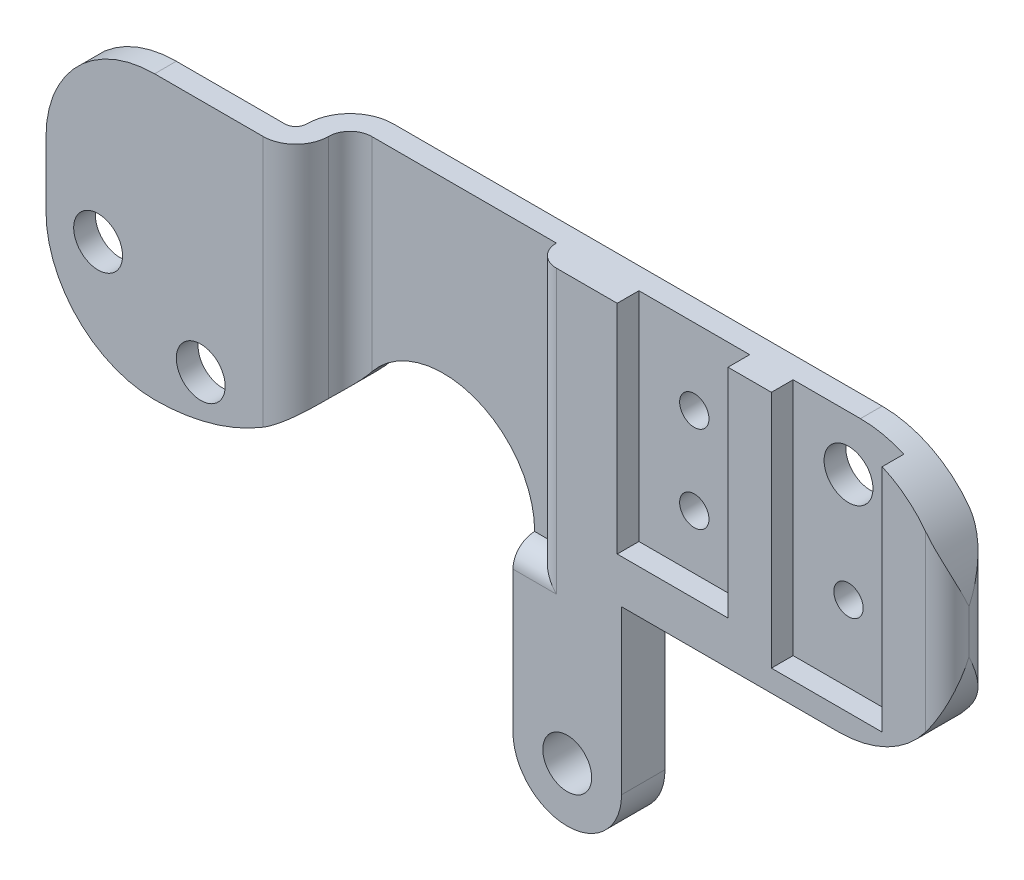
ISO-10303-21;
HEADER;
FILE_DESCRIPTION(('STEP AP214'),'2;1');
FILE_NAME('part.step','',(''),(''),'','','');
FILE_SCHEMA(('AUTOMOTIVE_DESIGN { 1 0 10303 214 1 1 1 1 }'));
ENDSEC;
DATA;
#1=APPLICATION_CONTEXT('core data for automotive mechanical design processes');
#2=APPLICATION_PROTOCOL_DEFINITION('international standard','automotive_design',2000,#1);
#3=PRODUCT_CONTEXT('',#1,'mechanical');
#4=PRODUCT('Part','Part','',(#3));
#5=PRODUCT_RELATED_PRODUCT_CATEGORY('part','',(#4));
#6=PRODUCT_DEFINITION_FORMATION('','',#4);
#7=PRODUCT_DEFINITION_CONTEXT('part definition',#1,'design');
#8=PRODUCT_DEFINITION('design','',#6,#7);
#9=PRODUCT_DEFINITION_SHAPE('','',#8);
#10=(LENGTH_UNIT() NAMED_UNIT(*) SI_UNIT(.MILLI.,.METRE.));
#11=(NAMED_UNIT(*) PLANE_ANGLE_UNIT() SI_UNIT($,.RADIAN.));
#12=(NAMED_UNIT(*) SI_UNIT($,.STERADIAN.) SOLID_ANGLE_UNIT());
#13=UNCERTAINTY_MEASURE_WITH_UNIT(LENGTH_MEASURE(1.E-05),#10,'distance_accuracy_value','');
#14=(GEOMETRIC_REPRESENTATION_CONTEXT(3) GLOBAL_UNCERTAINTY_ASSIGNED_CONTEXT((#13)) GLOBAL_UNIT_ASSIGNED_CONTEXT((#10,
#11,#12)) REPRESENTATION_CONTEXT('',''));
#15=CARTESIAN_POINT('',(0.,0.,0.));
#16=DIRECTION('',(0.,0.,1.));
#17=DIRECTION('',(1.,0.,0.));
#18=AXIS2_PLACEMENT_3D('',#15,#16,#17);
#19=CARTESIAN_POINT('',(31.75,33.02,11.43));
#20=DIRECTION('',(0.,0.,1.));
#21=DIRECTION('',(-1.,0.,0.));
#22=AXIS2_PLACEMENT_3D('',#19,#20,#21);
#23=PLANE('',#22);
#24=DIRECTION('',(0.,1.,0.));
#25=VECTOR('',#24,1.);
#26=CARTESIAN_POINT('',(53.34,0.,11.43));
#27=LINE('',#26,#25);
#28=CARTESIAN_POINT('',(53.34,2.54,11.43));
#29=VERTEX_POINT('',#28);
#30=CARTESIAN_POINT('',(53.34,33.02,11.43));
#31=VERTEX_POINT('',#30);
#32=EDGE_CURVE('E524',#29,#31,#27,.T.);
#33=ORIENTED_EDGE('',*,*,#32,.T.);
#34=DIRECTION('',(1.,0.,0.));
#35=VECTOR('',#34,1.);
#36=CARTESIAN_POINT('',(31.75,33.02,11.43));
#37=LINE('',#36,#35);
#38=CARTESIAN_POINT('',(31.75,33.02,11.43));
#39=VERTEX_POINT('',#38);
#40=EDGE_CURVE('E586',#39,#31,#37,.T.);
#41=ORIENTED_EDGE('',*,*,#40,.F.);
#42=DIRECTION('',(0.,-1.,0.));
#43=VECTOR('',#42,1.);
#44=CARTESIAN_POINT('',(31.75,33.02,11.43));
#45=LINE('',#44,#43);
#46=CARTESIAN_POINT('',(31.75,9.19068593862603,11.43));
#47=VERTEX_POINT('',#46);
#48=EDGE_CURVE('E396',#39,#47,#45,.T.);
#49=ORIENTED_EDGE('',*,*,#48,.T.);
#50=CARTESIAN_POINT('',(40.1140650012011,2.53999999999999,11.43));
#51=DIRECTION('',(0.,0.,-1.));
#52=DIRECTION('',(-1.,0.,0.));
#53=AXIS2_PLACEMENT_3D('',#50,#51,#52);
#54=CIRCLE('',#53,10.6859349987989);
#55=CARTESIAN_POINT('',(50.8,2.54,11.43));
#56=VERTEX_POINT('',#55);
#57=EDGE_CURVE('E432',#56,#47,#54,.F.);
#58=ORIENTED_EDGE('',*,*,#57,.F.);
#59=DIRECTION('',(1.,0.,0.));
#60=VECTOR('',#59,1.);
#61=CARTESIAN_POINT('',(63.5,2.54,11.43));
#62=LINE('',#61,#60);
#63=EDGE_CURVE('E256',#56,#29,#62,.T.);
#64=ORIENTED_EDGE('',*,*,#63,.T.);
#65=EDGE_LOOP('',(#33,#41,#49,#58,#64));
#66=FACE_BOUND('',#65,.T.);
#67=ADVANCED_FACE('F34',(#66),#23,.T.);
#68=CARTESIAN_POINT('',(101.6,2.54,8.89));
#69=DIRECTION('',(0.,-1.,0.));
#70=DIRECTION('',(1.,0.,0.));
#71=AXIS2_PLACEMENT_3D('',#68,#69,#70);
#72=PLANE('',#71);
#73=DIRECTION('',(0.,0.,-1.));
#74=VECTOR('',#73,1.);
#75=CARTESIAN_POINT('',(63.5,2.54,11.43));
#76=LINE('',#75,#74);
#77=CARTESIAN_POINT('',(63.5,2.54,13.97));
#78=VERTEX_POINT('',#77);
#79=CARTESIAN_POINT('',(63.5,2.54,8.89));
#80=VERTEX_POINT('',#79);
#81=EDGE_CURVE('E498',#78,#80,#76,.T.);
#82=ORIENTED_EDGE('',*,*,#81,.T.);
#83=DIRECTION('',(-1.,0.,0.));
#84=VECTOR('',#83,1.);
#85=CARTESIAN_POINT('',(101.6,2.54,8.89));
#86=LINE('',#85,#84);
#87=CARTESIAN_POINT('',(88.9,2.54,8.89));
#88=VERTEX_POINT('',#87);
#89=EDGE_CURVE('E501',#88,#80,#86,.T.);
#90=ORIENTED_EDGE('',*,*,#89,.F.);
#91=DIRECTION('',(0.,0.,1.));
#92=VECTOR('',#91,1.);
#93=CARTESIAN_POINT('',(88.9,2.54,8.89));
#94=LINE('',#93,#92);
#95=CARTESIAN_POINT('',(88.9,2.54,13.97));
#96=VERTEX_POINT('',#95);
#97=EDGE_CURVE('E340',#88,#96,#94,.T.);
#98=ORIENTED_EDGE('',*,*,#97,.T.);
#99=DIRECTION('',(-1.,0.,0.));
#100=VECTOR('',#99,1.);
#101=CARTESIAN_POINT('',(0.,2.53999999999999,13.97));
#102=LINE('',#101,#100);
#103=EDGE_CURVE('E391',#96,#78,#102,.T.);
#104=ORIENTED_EDGE('',*,*,#103,.T.);
#105=EDGE_LOOP('',(#82,#90,#98,#104));
#106=FACE_BOUND('',#105,.T.);
#107=ADVANCED_FACE('F656',(#106),#72,.T.);
#108=CARTESIAN_POINT('',(31.75,33.02,8.89));
#109=DIRECTION('',(0.,0.,1.));
#110=DIRECTION('',(-1.,0.,0.));
#111=AXIS2_PLACEMENT_3D('',#108,#109,#110);
#112=PLANE('',#111);
#113=CARTESIAN_POINT('',(57.15,-16.51,8.89));
#114=DIRECTION('',(0.,0.,1.));
#115=DIRECTION('',(1.,0.,0.));
#116=AXIS2_PLACEMENT_3D('',#113,#114,#115);
#117=CIRCLE('',#116,2.8575);
#118=CARTESIAN_POINT('',(60.0075,-16.51,8.89));
#119=VERTEX_POINT('',#118);
#120=EDGE_CURVE('E274',#119,#119,#117,.T.);
#121=ORIENTED_EDGE('',*,*,#120,.T.);
#122=EDGE_LOOP('',(#121));
#123=FACE_BOUND('',#122,.T.);
#124=CARTESIAN_POINT('',(87.503,26.67,8.89));
#125=DIRECTION('',(0.,0.,1.));
#126=DIRECTION('',(1.,0.,0.));
#127=AXIS2_PLACEMENT_3D('',#124,#125,#126);
#128=CIRCLE('',#127,2.8575);
#129=CARTESIAN_POINT('',(90.3605,26.67,8.89));
#130=VERTEX_POINT('',#129);
#131=EDGE_CURVE('E277',#130,#130,#128,.T.);
#132=ORIENTED_EDGE('',*,*,#131,.T.);
#133=EDGE_LOOP('',(#132));
#134=FACE_BOUND('',#133,.T.);
#135=CARTESIAN_POINT('',(69.469,13.97,8.89));
#136=DIRECTION('',(0.,0.,1.));
#137=DIRECTION('',(1.,0.,0.));
#138=AXIS2_PLACEMENT_3D('',#135,#136,#137);
#139=CIRCLE('',#138,1.71450000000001);
#140=CARTESIAN_POINT('',(67.7545,13.97,8.89));
#141=VERTEX_POINT('',#140);
#142=EDGE_CURVE('E506',#141,#141,#139,.T.);
#143=ORIENTED_EDGE('',*,*,#142,.T.);
#144=EDGE_LOOP('',(#143));
#145=FACE_BOUND('',#144,.T.);
#146=CARTESIAN_POINT('',(69.469,24.13,8.89));
#147=DIRECTION('',(0.,0.,1.));
#148=DIRECTION('',(1.,0.,0.));
#149=AXIS2_PLACEMENT_3D('',#146,#147,#148);
#150=CIRCLE('',#149,1.71450000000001);
#151=CARTESIAN_POINT('',(67.7545,24.13,8.89));
#152=VERTEX_POINT('',#151);
#153=EDGE_CURVE('E512',#152,#152,#150,.T.);
#154=ORIENTED_EDGE('',*,*,#153,.T.);
#155=EDGE_LOOP('',(#154));
#156=FACE_BOUND('',#155,.T.);
#157=CARTESIAN_POINT('',(87.503,13.97,8.89));
#158=DIRECTION('',(0.,0.,1.));
#159=DIRECTION('',(1.,0.,0.));
#160=AXIS2_PLACEMENT_3D('',#157,#158,#159);
#161=CIRCLE('',#160,1.7145);
#162=CARTESIAN_POINT('',(85.7885,13.97,8.89));
#163=VERTEX_POINT('',#162);
#164=EDGE_CURVE('E518',#163,#163,#161,.T.);
#165=ORIENTED_EDGE('',*,*,#164,.T.);
#166=EDGE_LOOP('',(#165));
#167=FACE_BOUND('',#166,.T.);
#168=CARTESIAN_POINT('',(88.9,20.32,8.89));
#169=DIRECTION('',(0.,0.,-1.));
#170=DIRECTION('',(1.,0.,0.));
#171=AXIS2_PLACEMENT_3D('',#168,#169,#170);
#172=CIRCLE('',#171,12.7);
#173=CARTESIAN_POINT('',(88.9,33.02,8.89));
#174=VERTEX_POINT('',#173);
#175=CARTESIAN_POINT('',(99.06,27.94,8.89));
#176=VERTEX_POINT('',#175);
#177=EDGE_CURVE('E290',#174,#176,#172,.T.);
#178=ORIENTED_EDGE('',*,*,#177,.T.);
#179=DIRECTION('',(0.,-1.,0.));
#180=VECTOR('',#179,1.);
#181=CARTESIAN_POINT('',(99.06,33.02,8.89));
#182=LINE('',#181,#180);
#183=CARTESIAN_POINT('',(99.06,7.62,8.89));
#184=VERTEX_POINT('',#183);
#185=EDGE_CURVE('E405',#184,#176,#182,.F.);
#186=ORIENTED_EDGE('',*,*,#185,.F.);
#187=CARTESIAN_POINT('',(88.9,15.24,8.89));
#188=DIRECTION('',(0.,0.,-1.));
#189=DIRECTION('',(1.,0.,0.));
#190=AXIS2_PLACEMENT_3D('',#187,#188,#189);
#191=CIRCLE('',#190,12.7);
#192=EDGE_CURVE('E659',#184,#88,#191,.T.);
#193=ORIENTED_EDGE('',*,*,#192,.T.);
#194=ORIENTED_EDGE('',*,*,#89,.T.);
#195=DIRECTION('',(0.,1.,0.));
#196=VECTOR('',#195,1.);
#197=CARTESIAN_POINT('',(63.5,2.54,8.89));
#198=LINE('',#197,#196);
#199=CARTESIAN_POINT('',(63.5,-16.51,8.89));
#200=VERTEX_POINT('',#199);
#201=EDGE_CURVE('E496',#200,#80,#198,.T.);
#202=ORIENTED_EDGE('',*,*,#201,.F.);
#203=CARTESIAN_POINT('',(57.15,-16.51,8.89));
#204=DIRECTION('',(0.,0.,1.));
#205=DIRECTION('',(1.,0.,0.));
#206=AXIS2_PLACEMENT_3D('',#203,#204,#205);
#207=CIRCLE('',#206,6.35);
#208=CARTESIAN_POINT('',(50.8,-16.51,8.89));
#209=VERTEX_POINT('',#208);
#210=EDGE_CURVE('E494',#209,#200,#207,.T.);
#211=ORIENTED_EDGE('',*,*,#210,.F.);
#212=DIRECTION('',(0.,-1.,0.));
#213=VECTOR('',#212,1.);
#214=CARTESIAN_POINT('',(50.8,2.54,8.89));
#215=LINE('',#214,#213);
#216=CARTESIAN_POINT('',(50.8,2.53999999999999,8.89));
#217=VERTEX_POINT('',#216);
#218=EDGE_CURVE('E244',#217,#209,#215,.T.);
#219=ORIENTED_EDGE('',*,*,#218,.F.);
#220=CARTESIAN_POINT('',(40.1140650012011,2.53999999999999,8.89));
#221=DIRECTION('',(0.,0.,1.));
#222=DIRECTION('',(1.,0.,0.));
#223=AXIS2_PLACEMENT_3D('',#220,#221,#222);
#224=CIRCLE('',#223,10.6859349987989);
#225=CARTESIAN_POINT('',(31.75,9.19068593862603,8.89));
#226=VERTEX_POINT('',#225);
#227=EDGE_CURVE('E639',#217,#226,#224,.T.);
#228=ORIENTED_EDGE('',*,*,#227,.T.);
#229=DIRECTION('',(0.,-1.,0.));
#230=VECTOR('',#229,1.);
#231=CARTESIAN_POINT('',(31.75,33.02,8.89));
#232=LINE('',#231,#230);
#233=CARTESIAN_POINT('',(31.75,33.02,8.89));
#234=VERTEX_POINT('',#233);
#235=EDGE_CURVE('E606',#234,#226,#232,.T.);
#236=ORIENTED_EDGE('',*,*,#235,.F.);
#237=DIRECTION('',(1.,0.,0.));
#238=VECTOR('',#237,1.);
#239=CARTESIAN_POINT('',(31.75,33.02,8.89));
#240=LINE('',#239,#238);
#241=EDGE_CURVE('E582',#234,#174,#240,.T.);
#242=ORIENTED_EDGE('',*,*,#241,.T.);
#243=EDGE_LOOP('',(#178,#186,#193,#194,#202,#211,#219,#228,#236,#242));
#244=FACE_BOUND('',#243,.T.);
#245=ADVANCED_FACE('F646',(#123,#134,#145,#156,#167,#244),#112,.F.);
#246=CARTESIAN_POINT('',(0.,0.,13.97));
#247=DIRECTION('',(0.,0.,1.));
#248=DIRECTION('',(-1.,0.,0.));
#249=AXIS2_PLACEMENT_3D('',#246,#247,#248);
#250=PLANE('',#249);
#251=DIRECTION('',(0.,1.,0.));
#252=VECTOR('',#251,1.);
#253=CARTESIAN_POINT('',(50.8,2.54,13.97));
#254=LINE('',#253,#252);
#255=CARTESIAN_POINT('',(50.8,-16.51,13.97));
#256=VERTEX_POINT('',#255);
#257=CARTESIAN_POINT('',(50.8,0.,13.97));
#258=VERTEX_POINT('',#257);
#259=EDGE_CURVE('E242',#256,#258,#254,.T.);
#260=ORIENTED_EDGE('',*,*,#259,.F.);
#261=CARTESIAN_POINT('',(57.15,-16.51,13.97));
#262=DIRECTION('',(0.,0.,-1.));
#263=DIRECTION('',(-1.,0.,0.));
#264=AXIS2_PLACEMENT_3D('',#261,#262,#263);
#265=CIRCLE('',#264,6.35);
#266=CARTESIAN_POINT('',(63.5,-16.51,13.97));
#267=VERTEX_POINT('',#266);
#268=EDGE_CURVE('E252',#267,#256,#265,.T.);
#269=ORIENTED_EDGE('',*,*,#268,.F.);
#270=DIRECTION('',(0.,-1.,0.));
#271=VECTOR('',#270,1.);
#272=CARTESIAN_POINT('',(63.5,-16.51,13.97));
#273=LINE('',#272,#271);
#274=EDGE_CURVE('E262',#78,#267,#273,.T.);
#275=ORIENTED_EDGE('',*,*,#274,.F.);
#276=ORIENTED_EDGE('',*,*,#103,.F.);
#277=CARTESIAN_POINT('',(88.9,15.24,13.97));
#278=DIRECTION('',(0.,0.,-1.));
#279=DIRECTION('',(-1.,0.,0.));
#280=AXIS2_PLACEMENT_3D('',#277,#278,#279);
#281=CIRCLE('',#280,12.7);
#282=CARTESIAN_POINT('',(99.06,7.62000000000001,13.97));
#283=VERTEX_POINT('',#282);
#284=EDGE_CURVE('E339',#283,#96,#281,.T.);
#285=ORIENTED_EDGE('',*,*,#284,.F.);
#286=DIRECTION('',(0.,-1.,0.));
#287=VECTOR('',#286,1.);
#288=CARTESIAN_POINT('',(99.06,0.,13.97));
#289=LINE('',#288,#287);
#290=CARTESIAN_POINT('',(99.06,27.94,13.97));
#291=VERTEX_POINT('',#290);
#292=EDGE_CURVE('E393',#291,#283,#289,.T.);
#293=ORIENTED_EDGE('',*,*,#292,.F.);
#294=CARTESIAN_POINT('',(88.9,20.32,13.97));
#295=DIRECTION('',(0.,0.,-1.));
#296=DIRECTION('',(-1.,0.,0.));
#297=AXIS2_PLACEMENT_3D('',#294,#295,#296);
#298=CIRCLE('',#297,12.7);
#299=CARTESIAN_POINT('',(93.98,31.9597422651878,13.97));
#300=VERTEX_POINT('',#299);
#301=EDGE_CURVE('E300',#300,#291,#298,.T.);
#302=ORIENTED_EDGE('',*,*,#301,.F.);
#303=DIRECTION('',(0.,1.,0.));
#304=VECTOR('',#303,1.);
#305=CARTESIAN_POINT('',(93.98,33.02,13.97));
#306=LINE('',#305,#304);
#307=CARTESIAN_POINT('',(93.98,5.08,13.97));
#308=VERTEX_POINT('',#307);
#309=EDGE_CURVE('E545',#308,#300,#306,.T.);
#310=ORIENTED_EDGE('',*,*,#309,.F.);
#311=DIRECTION('',(1.,0.,0.));
#312=VECTOR('',#311,1.);
#313=CARTESIAN_POINT('',(93.98,5.08,13.97));
#314=LINE('',#313,#312);
#315=CARTESIAN_POINT('',(81.026,5.08,13.97));
#316=VERTEX_POINT('',#315);
#317=EDGE_CURVE('E542',#316,#308,#314,.T.);
#318=ORIENTED_EDGE('',*,*,#317,.F.);
#319=DIRECTION('',(0.,-1.,0.));
#320=VECTOR('',#319,1.);
#321=CARTESIAN_POINT('',(81.026,33.02,13.97));
#322=LINE('',#321,#320);
#323=CARTESIAN_POINT('',(81.026,33.02,13.97));
#324=VERTEX_POINT('',#323);
#325=EDGE_CURVE('E539',#324,#316,#322,.T.);
#326=ORIENTED_EDGE('',*,*,#325,.F.);
#327=DIRECTION('',(1.,0.,0.));
#328=VECTOR('',#327,1.);
#329=CARTESIAN_POINT('',(75.946,33.02,13.97));
#330=LINE('',#329,#328);
#331=CARTESIAN_POINT('',(75.946,33.02,13.97));
#332=VERTEX_POINT('',#331);
#333=EDGE_CURVE('E536',#332,#324,#330,.T.);
#334=ORIENTED_EDGE('',*,*,#333,.F.);
#335=DIRECTION('',(0.,1.,0.));
#336=VECTOR('',#335,1.);
#337=CARTESIAN_POINT('',(75.946,33.02,13.97));
#338=LINE('',#337,#336);
#339=CARTESIAN_POINT('',(75.946,7.62,13.97));
#340=VERTEX_POINT('',#339);
#341=EDGE_CURVE('E533',#340,#332,#338,.T.);
#342=ORIENTED_EDGE('',*,*,#341,.F.);
#343=DIRECTION('',(1.,0.,0.));
#344=VECTOR('',#343,1.);
#345=CARTESIAN_POINT('',(75.946,7.62,13.97));
#346=LINE('',#345,#344);
#347=CARTESIAN_POINT('',(62.992,7.62,13.97));
#348=VERTEX_POINT('',#347);
#349=EDGE_CURVE('E530',#348,#340,#346,.T.);
#350=ORIENTED_EDGE('',*,*,#349,.F.);
#351=DIRECTION('',(0.,-1.,0.));
#352=VECTOR('',#351,1.);
#353=CARTESIAN_POINT('',(62.992,33.02,13.97));
#354=LINE('',#353,#352);
#355=CARTESIAN_POINT('',(62.992,33.02,13.97));
#356=VERTEX_POINT('',#355);
#357=EDGE_CURVE('E526',#356,#348,#354,.T.);
#358=ORIENTED_EDGE('',*,*,#357,.F.);
#359=DIRECTION('',(1.,0.,0.));
#360=VECTOR('',#359,1.);
#361=CARTESIAN_POINT('',(53.34,33.02,13.97));
#362=LINE('',#361,#360);
#363=CARTESIAN_POINT('',(55.88,33.02,13.97));
#364=VERTEX_POINT('',#363);
#365=EDGE_CURVE('E389',#364,#356,#362,.T.);
#366=ORIENTED_EDGE('',*,*,#365,.F.);
#367=DIRECTION('',(0.,1.,0.));
#368=VECTOR('',#367,1.);
#369=CARTESIAN_POINT('',(55.88,33.02,13.97));
#370=LINE('',#369,#368);
#371=CARTESIAN_POINT('',(55.88,0.,13.97));
#372=VERTEX_POINT('',#371);
#373=EDGE_CURVE('E386',#372,#364,#370,.T.);
#374=ORIENTED_EDGE('',*,*,#373,.F.);
#375=DIRECTION('',(1.,0.,0.));
#376=VECTOR('',#375,1.);
#377=CARTESIAN_POINT('',(55.88,0.,13.97));
#378=LINE('',#377,#376);
#379=EDGE_CURVE('E261',#258,#372,#378,.T.);
#380=ORIENTED_EDGE('',*,*,#379,.F.);
#381=EDGE_LOOP('',(#260,#269,#275,#276,#285,#293,#302,#310,#318,#326,#334,#342,#350,#358,#366,
#374,#380));
#382=FACE_BOUND('',#381,.T.);
#383=CARTESIAN_POINT('',(57.15,-16.51,13.97));
#384=DIRECTION('',(0.,0.,-1.));
#385=DIRECTION('',(-1.,0.,0.));
#386=AXIS2_PLACEMENT_3D('',#383,#384,#385);
#387=CIRCLE('',#386,2.8575);
#388=CARTESIAN_POINT('',(60.0075,-16.51,13.97));
#389=VERTEX_POINT('',#388);
#390=EDGE_CURVE('E270',#389,#389,#387,.T.);
#391=ORIENTED_EDGE('',*,*,#390,.T.);
#392=EDGE_LOOP('',(#391));
#393=FACE_BOUND('',#392,.T.);
#394=ADVANCED_FACE('F258',(#382,#393),#250,.T.);
#395=CARTESIAN_POINT('',(99.06,0.,11.43));
#396=DIRECTION('',(0.,-1.,0.));
#397=DIRECTION('',(0.,0.,1.));
#398=AXIS2_PLACEMENT_3D('',#395,#396,#397);
#399=CYLINDRICAL_SURFACE('',#398,2.54);
#400=ORIENTED_EDGE('',*,*,#292,.T.);
#401=CARTESIAN_POINT('',(99.06,7.62000000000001,13.97));
#402=CARTESIAN_POINT('',(99.1200536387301,7.70006896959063,13.9699942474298));
#403=CARTESIAN_POINT('',(99.1791432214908,7.7808298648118,13.9678709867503));
#404=CARTESIAN_POINT('',(99.2952925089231,7.9435709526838,13.9597492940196));
#405=CARTESIAN_POINT('',(99.3523528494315,8.02555075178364,13.9537520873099));
#406=CARTESIAN_POINT('',(99.5201694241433,8.27281827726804,13.9305178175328));
#407=CARTESIAN_POINT('',(99.6278020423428,8.43975548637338,13.9080351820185));
#408=CARTESIAN_POINT('',(99.8335816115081,8.77583877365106,13.8516679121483));
#409=CARTESIAN_POINT('',(99.9317879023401,8.94496221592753,13.8178615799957));
#410=CARTESIAN_POINT('',(100.119500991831,9.28595036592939,13.7407045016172));
#411=CARTESIAN_POINT('',(100.209002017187,9.45781680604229,13.6973474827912));
#412=CARTESIAN_POINT('',(100.433475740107,9.91379656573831,13.5725701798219));
#413=CARTESIAN_POINT('',(100.561124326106,10.1997153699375,13.4844897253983));
#414=CARTESIAN_POINT('',(100.793492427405,10.7755474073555,13.2926079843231));
#415=CARTESIAN_POINT('',(100.898202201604,11.0654622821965,13.1888000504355));
#416=CARTESIAN_POINT('',(101.085668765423,11.6492053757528,12.9692147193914));
#417=CARTESIAN_POINT('',(101.168338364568,11.9430444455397,12.8533922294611));
#418=CARTESIAN_POINT('',(101.311754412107,12.5325388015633,12.6135199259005));
#419=CARTESIAN_POINT('',(101.372507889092,12.8281934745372,12.4894727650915));
#420=CARTESIAN_POINT('',(101.481417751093,13.4728580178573,12.2136019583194));
#421=CARTESIAN_POINT('',(101.525481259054,13.8221093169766,12.0607292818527));
#422=CARTESIAN_POINT('',(101.584450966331,14.5207590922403,11.751623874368));
#423=CARTESIAN_POINT('',(101.599417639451,14.8701557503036,11.5953987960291));
#424=CARTESIAN_POINT('',(101.599994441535,15.2262833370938,11.4361342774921));
#425=CARTESIAN_POINT('',(101.599999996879,15.2331416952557,11.4330671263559));
#426=CARTESIAN_POINT('',(101.6,15.24,11.43));
#427=B_SPLINE_CURVE_WITH_KNOTS('',3,(#401,#402,#403,#404,#405,#406,#407,#408,#409,#410,#411,
#412,#413,#414,#415,#416,#417,#418,#419,#420,#421,#422,#423,#424,#425,#426),.UNSPECIFIED.,.F.,
.F.,(4,2,2,2,2,2,2,2,2,2,2,2,4),(0.,0.300191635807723,0.600288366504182,1.19928121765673,
1.79421478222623,2.38954025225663,3.36385193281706,4.33857656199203,5.31710181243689,
6.2953129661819,7.44551332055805,8.59332057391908,8.61585943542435),.UNSPECIFIED.);
#428=CARTESIAN_POINT('',(101.6,15.24,11.43));
#429=VERTEX_POINT('',#428);
#430=EDGE_CURVE('E333',#429,#283,#427,.F.);
#431=ORIENTED_EDGE('',*,*,#430,.F.);
#432=DIRECTION('',(0.,-1.,0.));
#433=VECTOR('',#432,1.);
#434=CARTESIAN_POINT('',(101.6,33.02,11.43));
#435=LINE('',#434,#433);
#436=CARTESIAN_POINT('',(101.6,20.32,11.43));
#437=VERTEX_POINT('',#436);
#438=EDGE_CURVE('E402',#429,#437,#435,.F.);
#439=ORIENTED_EDGE('',*,*,#438,.T.);
#440=CARTESIAN_POINT('',(99.06,27.94,13.97));
#441=CARTESIAN_POINT('',(99.12005363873,27.8599310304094,13.9699942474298));
#442=CARTESIAN_POINT('',(99.1791432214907,27.7791701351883,13.9678709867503));
#443=CARTESIAN_POINT('',(99.2952925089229,27.6164290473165,13.9597492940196));
#444=CARTESIAN_POINT('',(99.3523528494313,27.5344492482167,13.9537520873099));
#445=CARTESIAN_POINT('',(99.5201694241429,27.2871817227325,13.9305178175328));
#446=CARTESIAN_POINT('',(99.6278020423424,27.1202445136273,13.9080351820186));
#447=CARTESIAN_POINT('',(99.8335816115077,26.7841612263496,13.8516679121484));
#448=CARTESIAN_POINT('',(99.9317879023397,26.615037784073,13.8178615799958));
#449=CARTESIAN_POINT('',(100.119500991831,26.2740496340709,13.7407045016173));
#450=CARTESIAN_POINT('',(100.209002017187,26.1021831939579,13.6973474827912));
#451=CARTESIAN_POINT('',(100.433475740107,25.6462034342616,13.5725701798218));
#452=CARTESIAN_POINT('',(100.561124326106,25.3602846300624,13.4844897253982));
#453=CARTESIAN_POINT('',(100.793492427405,24.7844525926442,13.292607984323));
#454=CARTESIAN_POINT('',(100.898202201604,24.4945377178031,13.1888000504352));
#455=CARTESIAN_POINT('',(101.085668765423,23.9107946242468,12.9692147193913));
#456=CARTESIAN_POINT('',(101.168338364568,23.6169555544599,12.8533922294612));
#457=CARTESIAN_POINT('',(101.311754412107,23.0274611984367,12.6135199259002));
#458=CARTESIAN_POINT('',(101.372507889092,22.7318065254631,12.4894727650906));
#459=CARTESIAN_POINT('',(101.481417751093,22.0871419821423,12.2136019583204));
#460=CARTESIAN_POINT('',(101.525481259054,21.7378906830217,12.0607292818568));
#461=CARTESIAN_POINT('',(101.584450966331,21.0392409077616,11.751623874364));
#462=CARTESIAN_POINT('',(101.599417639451,20.6898442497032,11.5953987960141));
#463=CARTESIAN_POINT('',(101.599994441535,20.3337166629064,11.4361342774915));
#464=CARTESIAN_POINT('',(101.599999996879,20.3268583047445,11.4330671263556));
#465=CARTESIAN_POINT('',(101.6,20.32,11.43));
#466=B_SPLINE_CURVE_WITH_KNOTS('',3,(#440,#441,#442,#443,#444,#445,#446,#447,#448,#449,#450,
#451,#452,#453,#454,#455,#456,#457,#458,#459,#460,#461,#462,#463,#464,#465),.UNSPECIFIED.,.F.,
.F.,(4,2,2,2,2,2,2,2,2,2,2,2,4),(0.,0.300191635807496,0.600288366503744,1.19928121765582,
1.79421478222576,2.38954025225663,3.36385193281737,4.33857656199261,5.31710181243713,
6.29531296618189,7.445513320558,8.5933205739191,8.61585943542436),.UNSPECIFIED.);
#467=EDGE_CURVE('E303',#291,#437,#466,.T.);
#468=ORIENTED_EDGE('',*,*,#467,.F.);
#469=EDGE_LOOP('',(#400,#431,#439,#468));
#470=FACE_BOUND('',#469,.T.);
#471=ADVANCED_FACE('F321',(#470),#399,.T.);
#472=CARTESIAN_POINT('',(99.06,33.02,11.43));
#473=DIRECTION('',(0.,1.,0.));
#474=DIRECTION('',(0.,0.,-1.));
#475=AXIS2_PLACEMENT_3D('',#472,#473,#474);
#476=CYLINDRICAL_SURFACE('',#475,2.54);
#477=ORIENTED_EDGE('',*,*,#438,.F.);
#478=CARTESIAN_POINT('',(99.06,7.62,8.89));
#479=CARTESIAN_POINT('',(99.1200536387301,7.70006896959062,8.8900057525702));
#480=CARTESIAN_POINT('',(99.1791432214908,7.78082986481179,8.89212901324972));
#481=CARTESIAN_POINT('',(99.2952925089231,7.94357095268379,8.90025070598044));
#482=CARTESIAN_POINT('',(99.3523528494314,8.02555075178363,8.90624791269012));
#483=CARTESIAN_POINT('',(99.5201694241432,8.27281827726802,8.92948218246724));
#484=CARTESIAN_POINT('',(99.6278020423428,8.43975548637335,8.95196481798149));
#485=CARTESIAN_POINT('',(99.8335816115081,8.77583877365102,9.00833208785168));
#486=CARTESIAN_POINT('',(99.93178790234,8.9449622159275,9.04213842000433));
#487=CARTESIAN_POINT('',(100.119500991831,9.28595036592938,9.11929549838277));
#488=CARTESIAN_POINT('',(100.209002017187,9.45781680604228,9.16265251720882));
#489=CARTESIAN_POINT('',(100.433475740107,9.91379656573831,9.28742982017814));
#490=CARTESIAN_POINT('',(100.561124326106,10.1997153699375,9.37551027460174));
#491=CARTESIAN_POINT('',(100.793492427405,10.7755474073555,9.56739201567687));
#492=CARTESIAN_POINT('',(100.898202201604,11.0654622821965,9.67119994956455));
#493=CARTESIAN_POINT('',(101.085668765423,11.6492053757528,9.89078528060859));
#494=CARTESIAN_POINT('',(101.168338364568,11.9430444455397,10.0066077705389));
#495=CARTESIAN_POINT('',(101.311754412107,12.5325388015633,10.2464800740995));
#496=CARTESIAN_POINT('',(101.372507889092,12.8281934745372,10.3705272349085));
#497=CARTESIAN_POINT('',(101.481417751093,13.4728580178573,10.6463980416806));
#498=CARTESIAN_POINT('',(101.525481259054,13.8221093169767,10.7992707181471));
#499=CARTESIAN_POINT('',(101.584450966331,14.5207590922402,11.1083761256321));
#500=CARTESIAN_POINT('',(101.599417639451,14.8701557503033,11.2646012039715));
#501=CARTESIAN_POINT('',(101.599994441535,15.2262833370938,11.4238657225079));
#502=CARTESIAN_POINT('',(101.599999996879,15.2331416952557,11.4269328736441));
#503=CARTESIAN_POINT('',(101.6,15.24,11.43));
#504=B_SPLINE_CURVE_WITH_KNOTS('',3,(#478,#479,#480,#481,#482,#483,#484,#485,#486,#487,#488,
#489,#490,#491,#492,#493,#494,#495,#496,#497,#498,#499,#500,#501,#502,#503),.UNSPECIFIED.,.F.,
.F.,(4,2,2,2,2,2,2,2,2,2,2,2,4),(0.,0.300191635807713,0.600288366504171,1.1992812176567,
1.7942147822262,2.38954025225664,3.36385193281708,4.33857656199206,5.31710181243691,
6.29531296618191,7.44551332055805,8.59332057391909,8.61585943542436),.UNSPECIFIED.);
#505=EDGE_CURVE('E353',#184,#429,#504,.T.);
#506=ORIENTED_EDGE('',*,*,#505,.F.);
#507=ORIENTED_EDGE('',*,*,#185,.T.);
#508=CARTESIAN_POINT('',(99.06,27.94,8.89));
#509=CARTESIAN_POINT('',(99.12005363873,27.8599310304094,8.8900057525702));
#510=CARTESIAN_POINT('',(99.1791432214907,27.7791701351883,8.89212901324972));
#511=CARTESIAN_POINT('',(99.295292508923,27.6164290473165,8.90025070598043));
#512=CARTESIAN_POINT('',(99.3523528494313,27.5344492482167,8.9062479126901));
#513=CARTESIAN_POINT('',(99.5201694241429,27.2871817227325,8.92948218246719));
#514=CARTESIAN_POINT('',(99.6278020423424,27.1202445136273,8.95196481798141));
#515=CARTESIAN_POINT('',(99.8335816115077,26.7841612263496,9.00833208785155));
#516=CARTESIAN_POINT('',(99.9317879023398,26.615037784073,9.04213842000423));
#517=CARTESIAN_POINT('',(100.119500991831,26.2740496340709,9.1192954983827));
#518=CARTESIAN_POINT('',(100.209002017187,26.1021831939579,9.16265251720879));
#519=CARTESIAN_POINT('',(100.433475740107,25.6462034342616,9.28742982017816));
#520=CARTESIAN_POINT('',(100.561124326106,25.3602846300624,9.37551027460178));
#521=CARTESIAN_POINT('',(100.793492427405,24.7844525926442,9.567392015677));
#522=CARTESIAN_POINT('',(100.898202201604,24.4945377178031,9.67119994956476));
#523=CARTESIAN_POINT('',(101.085668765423,23.9107946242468,9.89078528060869));
#524=CARTESIAN_POINT('',(101.168338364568,23.6169555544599,10.0066077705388));
#525=CARTESIAN_POINT('',(101.311754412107,23.0274611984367,10.2464800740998));
#526=CARTESIAN_POINT('',(101.372507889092,22.7318065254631,10.3705272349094));
#527=CARTESIAN_POINT('',(101.481417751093,22.0871419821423,10.6463980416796));
#528=CARTESIAN_POINT('',(101.525481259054,21.7378906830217,10.7992707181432));
#529=CARTESIAN_POINT('',(101.584450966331,21.0392409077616,11.108376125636));
#530=CARTESIAN_POINT('',(101.599417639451,20.6898442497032,11.2646012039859));
#531=CARTESIAN_POINT('',(101.599994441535,20.3337166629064,11.4238657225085));
#532=CARTESIAN_POINT('',(101.599999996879,20.3268583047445,11.4269328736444));
#533=CARTESIAN_POINT('',(101.6,20.32,11.43));
#534=B_SPLINE_CURVE_WITH_KNOTS('',3,(#508,#509,#510,#511,#512,#513,#514,#515,#516,#517,#518,
#519,#520,#521,#522,#523,#524,#525,#526,#527,#528,#529,#530,#531,#532,#533),.UNSPECIFIED.,.F.,
.F.,(4,2,2,2,2,2,2,2,2,2,2,2,4),(0.,0.300191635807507,0.600288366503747,1.19928121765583,
1.79421478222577,2.38954025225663,3.36385193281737,4.3385765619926,5.31710181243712,
6.29531296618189,7.445513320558,8.59332057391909,8.61585943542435),.UNSPECIFIED.);
#535=EDGE_CURVE('E311',#437,#176,#534,.F.);
#536=ORIENTED_EDGE('',*,*,#535,.F.);
#537=EDGE_LOOP('',(#477,#506,#507,#536));
#538=FACE_BOUND('',#537,.T.);
#539=ADVANCED_FACE('F325',(#538),#476,.T.);
#540=CARTESIAN_POINT('',(87.503,26.67,11.43));
#541=DIRECTION('',(0.,0.,-1.));
#542=DIRECTION('',(-1.,0.,0.));
#543=AXIS2_PLACEMENT_3D('',#540,#541,#542);
#544=CIRCLE('',#543,2.8575);
#545=CARTESIAN_POINT('',(90.3605,26.67,11.43));
#546=VERTEX_POINT('',#545);
#547=EDGE_CURVE('E280',#546,#546,#544,.T.);
#548=ORIENTED_EDGE('',*,*,#547,.T.);
#549=EDGE_LOOP('',(#548));
#550=FACE_BOUND('',#549,.T.);
#551=CARTESIAN_POINT('',(87.503,13.97,11.43));
#552=DIRECTION('',(0.,0.,-1.));
#553=DIRECTION('',(-1.,0.,0.));
#554=AXIS2_PLACEMENT_3D('',#551,#552,#553);
#555=CIRCLE('',#554,1.7145);
#556=CARTESIAN_POINT('',(85.7885,13.97,11.43));
#557=VERTEX_POINT('',#556);
#558=EDGE_CURVE('E521',#557,#557,#555,.F.);
#559=ORIENTED_EDGE('',*,*,#558,.F.);
#560=EDGE_LOOP('',(#559));
#561=FACE_BOUND('',#560,.T.);
#562=CARTESIAN_POINT('',(81.026,33.02,11.43));
#563=VERTEX_POINT('',#562);
#564=CARTESIAN_POINT('',(88.9,33.02,11.43));
#565=VERTEX_POINT('',#564);
#566=EDGE_CURVE('E585',#563,#565,#37,.T.);
#567=ORIENTED_EDGE('',*,*,#566,.F.);
#568=DIRECTION('',(0.,-1.,0.));
#569=VECTOR('',#568,1.);
#570=CARTESIAN_POINT('',(81.026,33.02,11.43));
#571=LINE('',#570,#569);
#572=CARTESIAN_POINT('',(81.026,5.08,11.43));
#573=VERTEX_POINT('',#572);
#574=EDGE_CURVE('E559',#563,#573,#571,.T.);
#575=ORIENTED_EDGE('',*,*,#574,.T.);
#576=DIRECTION('',(1.,0.,0.));
#577=VECTOR('',#576,1.);
#578=CARTESIAN_POINT('',(93.98,5.08,11.43));
#579=LINE('',#578,#577);
#580=CARTESIAN_POINT('',(93.98,5.08,11.43));
#581=VERTEX_POINT('',#580);
#582=EDGE_CURVE('E562',#573,#581,#579,.T.);
#583=ORIENTED_EDGE('',*,*,#582,.T.);
#584=DIRECTION('',(0.,1.,0.));
#585=VECTOR('',#584,1.);
#586=CARTESIAN_POINT('',(93.98,33.02,11.43));
#587=LINE('',#586,#585);
#588=CARTESIAN_POINT('',(93.98,31.9597422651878,11.43));
#589=VERTEX_POINT('',#588);
#590=EDGE_CURVE('E527',#581,#589,#587,.T.);
#591=ORIENTED_EDGE('',*,*,#590,.T.);
#592=CARTESIAN_POINT('',(88.9,20.32,11.43));
#593=DIRECTION('',(0.,0.,-1.));
#594=DIRECTION('',(-1.,0.,0.));
#595=AXIS2_PLACEMENT_3D('',#592,#593,#594);
#596=CIRCLE('',#595,12.7);
#597=EDGE_CURVE('E297',#565,#589,#596,.T.);
#598=ORIENTED_EDGE('',*,*,#597,.F.);
#599=EDGE_LOOP('',(#567,#575,#583,#591,#598));
#600=FACE_BOUND('',#599,.T.);
#601=ADVANCED_FACE('F673',(#550,#561,#600),#23,.T.);
#602=CARTESIAN_POINT('',(31.75,33.02,13.97));
#603=DIRECTION('',(0.,1.,0.));
#604=DIRECTION('',(1.,0.,0.));
#605=AXIS2_PLACEMENT_3D('',#602,#603,#604);
#606=PLANE('',#605);
#607=DIRECTION('',(1.,0.,0.));
#608=VECTOR('',#607,1.);
#609=CARTESIAN_POINT('',(0.,33.02,17.78));
#610=LINE('',#609,#608);
#611=CARTESIAN_POINT('',(12.7,33.02,17.78));
#612=VERTEX_POINT('',#611);
#613=CARTESIAN_POINT('',(25.4,33.02,17.78));
#614=VERTEX_POINT('',#613);
#615=EDGE_CURVE('E595',#612,#614,#610,.T.);
#616=ORIENTED_EDGE('',*,*,#615,.T.);
#617=CARTESIAN_POINT('',(25.4,33.02,13.97));
#618=DIRECTION('',(0.,1.,0.));
#619=DIRECTION('',(0.,0.,1.));
#620=AXIS2_PLACEMENT_3D('',#617,#618,#619);
#621=CIRCLE('',#620,3.81);
#622=CARTESIAN_POINT('',(29.21,33.02,13.97));
#623=VERTEX_POINT('',#622);
#624=EDGE_CURVE('E592',#614,#623,#621,.T.);
#625=ORIENTED_EDGE('',*,*,#624,.T.);
#626=CARTESIAN_POINT('',(31.75,33.02,13.97));
#627=DIRECTION('',(0.,-1.,0.));
#628=DIRECTION('',(0.,0.,-1.));
#629=AXIS2_PLACEMENT_3D('',#626,#627,#628);
#630=CIRCLE('',#629,2.54);
#631=EDGE_CURVE('E589',#623,#39,#630,.T.);
#632=ORIENTED_EDGE('',*,*,#631,.T.);
#633=ORIENTED_EDGE('',*,*,#40,.T.);
#634=CARTESIAN_POINT('',(55.88,33.02,11.43));
#635=DIRECTION('',(0.,-1.,0.));
#636=DIRECTION('',(0.,0.,-1.));
#637=AXIS2_PLACEMENT_3D('',#634,#635,#636);
#638=CIRCLE('',#637,2.54);
#639=EDGE_CURVE('E390',#364,#31,#638,.T.);
#640=ORIENTED_EDGE('',*,*,#639,.F.);
#641=ORIENTED_EDGE('',*,*,#365,.T.);
#642=DIRECTION('',(0.,0.,-1.));
#643=VECTOR('',#642,1.);
#644=CARTESIAN_POINT('',(62.992,33.02,13.97));
#645=LINE('',#644,#643);
#646=CARTESIAN_POINT('',(62.992,33.02,11.43));
#647=VERTEX_POINT('',#646);
#648=EDGE_CURVE('E579',#356,#647,#645,.T.);
#649=ORIENTED_EDGE('',*,*,#648,.T.);
#650=CARTESIAN_POINT('',(75.946,33.02,11.43));
#651=VERTEX_POINT('',#650);
#652=EDGE_CURVE('E590',#647,#651,#37,.T.);
#653=ORIENTED_EDGE('',*,*,#652,.T.);
#654=DIRECTION('',(0.,0.,-1.));
#655=VECTOR('',#654,1.);
#656=CARTESIAN_POINT('',(75.946,33.02,13.97));
#657=LINE('',#656,#655);
#658=EDGE_CURVE('E572',#332,#651,#657,.T.);
#659=ORIENTED_EDGE('',*,*,#658,.F.);
#660=ORIENTED_EDGE('',*,*,#333,.T.);
#661=DIRECTION('',(0.,0.,-1.));
#662=VECTOR('',#661,1.);
#663=CARTESIAN_POINT('',(81.026,33.02,13.97));
#664=LINE('',#663,#662);
#665=EDGE_CURVE('E570',#324,#563,#664,.T.);
#666=ORIENTED_EDGE('',*,*,#665,.T.);
#667=ORIENTED_EDGE('',*,*,#566,.T.);
#668=DIRECTION('',(0.,0.,1.));
#669=VECTOR('',#668,1.);
#670=CARTESIAN_POINT('',(88.9,33.02,8.89));
#671=LINE('',#670,#669);
#672=EDGE_CURVE('E295',#174,#565,#671,.T.);
#673=ORIENTED_EDGE('',*,*,#672,.F.);
#674=ORIENTED_EDGE('',*,*,#241,.F.);
#675=CARTESIAN_POINT('',(31.75,33.02,13.97));
#676=DIRECTION('',(0.,-1.,0.));
#677=DIRECTION('',(1.,0.,0.));
#678=AXIS2_PLACEMENT_3D('',#675,#676,#677);
#679=CIRCLE('',#678,5.08);
#680=CARTESIAN_POINT('',(26.67,33.02,13.97));
#681=VERTEX_POINT('',#680);
#682=EDGE_CURVE('E604',#681,#234,#679,.T.);
#683=ORIENTED_EDGE('',*,*,#682,.F.);
#684=CARTESIAN_POINT('',(25.4,33.02,13.97));
#685=DIRECTION('',(0.,-1.,0.));
#686=DIRECTION('',(1.,0.,0.));
#687=AXIS2_PLACEMENT_3D('',#684,#685,#686);
#688=CIRCLE('',#687,1.27);
#689=CARTESIAN_POINT('',(25.4,33.02,15.24));
#690=VERTEX_POINT('',#689);
#691=EDGE_CURVE('E601',#690,#681,#688,.F.);
#692=ORIENTED_EDGE('',*,*,#691,.F.);
#693=DIRECTION('',(1.,0.,0.));
#694=VECTOR('',#693,1.);
#695=CARTESIAN_POINT('',(0.,33.02,15.24));
#696=LINE('',#695,#694);
#697=CARTESIAN_POINT('',(12.7,33.02,15.24));
#698=VERTEX_POINT('',#697);
#699=EDGE_CURVE('E598',#698,#690,#696,.T.);
#700=ORIENTED_EDGE('',*,*,#699,.F.);
#701=DIRECTION('',(0.,0.,1.));
#702=VECTOR('',#701,1.);
#703=CARTESIAN_POINT('',(12.7,33.02,13.97));
#704=LINE('',#703,#702);
#705=EDGE_CURVE('E367',#612,#698,#704,.F.);
#706=ORIENTED_EDGE('',*,*,#705,.F.);
#707=EDGE_LOOP('',(#616,#625,#632,#633,#640,#641,#649,#653,#659,#660,#666,#667,#673,#674,#683,
#692,#700,#706));
#708=FACE_BOUND('',#707,.T.);
#709=ADVANCED_FACE('F459',(#708),#606,.T.);
#710=CARTESIAN_POINT('',(93.98,33.02,13.97));
#711=DIRECTION('',(1.,0.,0.));
#712=DIRECTION('',(0.,0.,1.));
#713=AXIS2_PLACEMENT_3D('',#710,#711,#712);
#714=PLANE('',#713);
#715=DIRECTION('',(0.,0.,1.));
#716=VECTOR('',#715,1.);
#717=CARTESIAN_POINT('',(93.98,31.9597422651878,8.89));
#718=LINE('',#717,#716);
#719=EDGE_CURVE('E359',#300,#589,#718,.F.);
#720=ORIENTED_EDGE('',*,*,#719,.T.);
#721=ORIENTED_EDGE('',*,*,#590,.F.);
#722=DIRECTION('',(0.,0.,-1.));
#723=VECTOR('',#722,1.);
#724=CARTESIAN_POINT('',(93.98,5.08,13.97));
#725=LINE('',#724,#723);
#726=EDGE_CURVE('E548',#308,#581,#725,.T.);
#727=ORIENTED_EDGE('',*,*,#726,.F.);
#728=ORIENTED_EDGE('',*,*,#309,.T.);
#729=EDGE_LOOP('',(#720,#721,#727,#728));
#730=FACE_BOUND('',#729,.T.);
#731=ADVANCED_FACE('F485',(#730),#714,.F.);
#732=CARTESIAN_POINT('',(31.75,33.02,13.97));
#733=DIRECTION('',(0.,-1.,0.));
#734=DIRECTION('',(0.,0.,1.));
#735=AXIS2_PLACEMENT_3D('',#732,#733,#734);
#736=CYLINDRICAL_SURFACE('',#735,2.54);
#737=ORIENTED_EDGE('',*,*,#48,.F.);
#738=ORIENTED_EDGE('',*,*,#631,.F.);
#739=DIRECTION('',(0.,-1.,0.));
#740=VECTOR('',#739,1.);
#741=CARTESIAN_POINT('',(29.21,33.02,13.97));
#742=LINE('',#741,#740);
#743=CARTESIAN_POINT('',(29.21,6.45611187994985,13.97));
#744=VERTEX_POINT('',#743);
#745=EDGE_CURVE('E623',#623,#744,#742,.T.);
#746=ORIENTED_EDGE('',*,*,#745,.T.);
#747=CARTESIAN_POINT('',(31.75,9.19068593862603,11.43));
#748=CARTESIAN_POINT('',(31.6521562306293,9.0676105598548,11.4300407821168));
#749=CARTESIAN_POINT('',(31.5530374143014,8.94542844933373,11.4356601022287));
#750=CARTESIAN_POINT('',(31.3527231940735,8.70330039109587,11.4592155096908));
#751=CARTESIAN_POINT('',(31.2515218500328,8.58336351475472,11.477193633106));
#752=CARTESIAN_POINT('',(31.0468462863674,8.34545981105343,11.5269698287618));
#753=CARTESIAN_POINT('',(30.943359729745,8.22754028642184,11.5589482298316));
#754=CARTESIAN_POINT('',(30.7369116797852,7.9967436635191,11.6381636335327));
#755=CARTESIAN_POINT('',(30.6339496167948,7.88385893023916,11.6853765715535));
#756=CARTESIAN_POINT('',(30.4200300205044,7.65356664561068,11.8022623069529));
#757=CARTESIAN_POINT('',(30.3092976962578,7.53682868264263,11.8737039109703));
#758=CARTESIAN_POINT('',(30.094360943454,7.31441347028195,12.03900535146));
#759=CARTESIAN_POINT('',(29.9901321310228,7.20869376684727,12.1327741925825));
#760=CARTESIAN_POINT('',(29.8114597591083,7.03039609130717,12.3245659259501));
#761=CARTESIAN_POINT('',(29.7351034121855,6.95532612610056,12.4184624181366));
#762=CARTESIAN_POINT('',(29.5933675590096,6.81755143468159,12.6224436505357));
#763=CARTESIAN_POINT('',(29.5279813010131,6.75483909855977,12.7325183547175));
#764=CARTESIAN_POINT('',(29.4232132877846,6.65522524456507,12.9457671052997));
#765=CARTESIAN_POINT('',(29.3812580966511,6.61569440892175,13.0464420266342));
#766=CARTESIAN_POINT('',(29.3099515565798,6.54884622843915,13.2558963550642));
#767=CARTESIAN_POINT('',(29.2805769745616,6.52150636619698,13.3646603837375));
#768=CARTESIAN_POINT('',(29.2425548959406,6.48621061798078,13.5564294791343));
#769=CARTESIAN_POINT('',(29.2304105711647,6.47497427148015,13.6381508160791));
#770=CARTESIAN_POINT('',(29.2181984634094,6.46368393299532,13.7618953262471));
#771=CARTESIAN_POINT('',(29.2151284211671,6.46084779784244,13.8033940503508));
#772=CARTESIAN_POINT('',(29.2110275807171,6.45706056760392,13.8865917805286));
#773=CARTESIAN_POINT('',(29.2099974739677,6.45611011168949,13.9282908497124));
#774=CARTESIAN_POINT('',(29.21,6.45611187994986,13.97));
#775=B_SPLINE_CURVE_WITH_KNOTS('',3,(#747,#748,#749,#750,#751,#752,#753,#754,#755,#756,#757,
#758,#759,#760,#761,#762,#763,#764,#765,#766,#767,#768,#769,#770,#771,#772,#773,#774),
.UNSPECIFIED.,.F.,.F.,(4,2,2,2,2,2,2,2,2,2,2,2,2,4),(0.,0.471722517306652,0.945057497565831,
1.42467731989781,1.90354320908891,2.43011017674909,2.95456676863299,3.38026008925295,
3.80569044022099,4.15231011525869,4.4982868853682,4.74769475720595,4.87273671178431,
4.99782104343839),.UNSPECIFIED.);
#776=EDGE_CURVE('E487',#47,#744,#775,.T.);
#777=ORIENTED_EDGE('',*,*,#776,.F.);
#778=EDGE_LOOP('',(#737,#738,#746,#777));
#779=FACE_BOUND('',#778,.T.);
#780=ADVANCED_FACE('F480',(#779),#736,.F.);
#781=CARTESIAN_POINT('',(25.4,33.02,13.97));
#782=DIRECTION('',(0.,-1.,0.));
#783=DIRECTION('',(0.,0.,1.));
#784=AXIS2_PLACEMENT_3D('',#781,#782,#783);
#785=CYLINDRICAL_SURFACE('',#784,3.81);
#786=ORIENTED_EDGE('',*,*,#745,.F.);
#787=ORIENTED_EDGE('',*,*,#624,.F.);
#788=DIRECTION('',(0.,-1.,0.));
#789=VECTOR('',#788,1.);
#790=CARTESIAN_POINT('',(25.4,33.02,17.78));
#791=LINE('',#790,#789);
#792=CARTESIAN_POINT('',(25.4,3.57624821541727,17.78));
#793=VERTEX_POINT('',#792);
#794=EDGE_CURVE('E620',#614,#793,#791,.T.);
#795=ORIENTED_EDGE('',*,*,#794,.T.);
#796=CARTESIAN_POINT('',(29.21,6.45611187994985,13.97));
#797=CARTESIAN_POINT('',(29.2100217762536,6.45613805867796,14.0588581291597));
#798=CARTESIAN_POINT('',(29.2068922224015,6.45324269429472,14.1476975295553));
#799=CARTESIAN_POINT('',(29.1944995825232,6.44180972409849,14.3245079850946));
#800=CARTESIAN_POINT('',(29.1852417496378,6.43327695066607,14.4124797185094));
#801=CARTESIAN_POINT('',(29.160869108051,6.41086863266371,14.5861096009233));
#802=CARTESIAN_POINT('',(29.1458066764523,6.39704087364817,14.6717813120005));
#803=CARTESIAN_POINT('',(29.1101197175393,6.3643936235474,14.8409747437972));
#804=CARTESIAN_POINT('',(29.089494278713,6.34557331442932,14.9244961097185));
#805=CARTESIAN_POINT('',(29.0199267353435,6.28236828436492,15.1704713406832));
#806=CARTESIAN_POINT('',(28.9631880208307,6.23114103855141,15.3290581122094));
#807=CARTESIAN_POINT('',(28.8318846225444,6.11406354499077,15.6330867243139));
#808=CARTESIAN_POINT('',(28.7572742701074,6.04817586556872,15.7784935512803));
#809=CARTESIAN_POINT('',(28.560112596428,5.87664481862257,16.1102042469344));
#810=CARTESIAN_POINT('',(28.4303430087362,5.76566372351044,16.2894714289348));
#811=CARTESIAN_POINT('',(28.1477526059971,5.52995970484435,16.6182253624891));
#812=CARTESIAN_POINT('',(27.9949003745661,5.40521811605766,16.767670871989));
#813=CARTESIAN_POINT('',(27.6677298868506,5.14548120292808,17.0391205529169));
#814=CARTESIAN_POINT('',(27.4930638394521,5.01033781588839,17.1605596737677));
#815=CARTESIAN_POINT('',(27.1283172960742,4.73655648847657,17.371969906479));
#816=CARTESIAN_POINT('',(26.9382463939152,4.59792075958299,17.4619604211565));
#817=CARTESIAN_POINT('',(26.6360677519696,4.38445902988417,17.575702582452));
#818=CARTESIAN_POINT('',(26.5281950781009,4.30953638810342,17.6109026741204));
#819=CARTESIAN_POINT('',(26.3093774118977,4.16021401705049,17.6716240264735));
#820=CARTESIAN_POINT('',(26.1984324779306,4.08581427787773,17.6971454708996));
#821=CARTESIAN_POINT('',(25.9739630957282,3.93798770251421,17.7382484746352));
#822=CARTESIAN_POINT('',(25.8604368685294,3.86456159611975,17.7538229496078));
#823=CARTESIAN_POINT('',(25.6314827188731,3.71918139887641,17.7746978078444));
#824=CARTESIAN_POINT('',(25.5160543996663,3.64722762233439,17.7799960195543));
#825=CARTESIAN_POINT('',(25.4,3.57624821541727,17.78));
#826=B_SPLINE_CURVE_WITH_KNOTS('',3,(#796,#797,#798,#799,#800,#801,#802,#803,#804,#805,#806,
#807,#808,#809,#810,#811,#812,#813,#814,#815,#816,#817,#818,#819,#820,#821,#822,#823,#824,#825),
.UNSPECIFIED.,.F.,.F.,(4,2,2,2,2,2,2,2,2,2,2,2,2,2,4),(0.,0.266441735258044,0.532655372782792,
0.796521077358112,1.06043004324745,1.58606905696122,2.11306587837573,2.85176955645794,
3.59148785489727,4.34503077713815,5.09810796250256,5.50571139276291,5.91330708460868,
6.32119274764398,6.72916459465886),.UNSPECIFIED.);
#827=EDGE_CURVE('E446',#744,#793,#826,.T.);
#828=ORIENTED_EDGE('',*,*,#827,.F.);
#829=EDGE_LOOP('',(#786,#787,#795,#828));
#830=FACE_BOUND('',#829,.T.);
#831=ADVANCED_FACE('F457',(#830),#785,.T.);
#832=CARTESIAN_POINT('',(31.75,33.02,13.97));
#833=DIRECTION('',(0.,-1.,0.));
#834=DIRECTION('',(0.,0.,1.));
#835=AXIS2_PLACEMENT_3D('',#832,#833,#834);
#836=CYLINDRICAL_SURFACE('',#835,5.08);
#837=CARTESIAN_POINT('',(31.75,9.19068593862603,8.89));
#838=CARTESIAN_POINT('',(31.6651908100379,9.08402634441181,8.89000296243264));
#839=CARTESIAN_POINT('',(31.5794881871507,8.97808546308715,8.89212378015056));
#840=CARTESIAN_POINT('',(31.4063941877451,8.76774810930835,8.90089228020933));
#841=CARTESIAN_POINT('',(31.3190024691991,8.66335195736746,8.90754088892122));
#842=CARTESIAN_POINT('',(31.0539823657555,8.3521058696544,8.93476661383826));
#843=CARTESIAN_POINT('',(30.8740021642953,8.14781835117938,8.96262706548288));
#844=CARTESIAN_POINT('',(30.5072657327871,7.74526003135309,9.04074479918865));
#845=CARTESIAN_POINT('',(30.3204546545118,7.54708846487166,9.09126206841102));
#846=CARTESIAN_POINT('',(29.9447793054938,7.1614910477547,9.2174405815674));
#847=CARTESIAN_POINT('',(29.7559183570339,6.97405021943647,9.29306572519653));
#848=CARTESIAN_POINT('',(29.3379010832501,6.57221275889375,9.49197968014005));
#849=CARTESIAN_POINT('',(29.1089266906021,6.36083583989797,9.62206197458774));
#850=CARTESIAN_POINT('',(28.773542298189,6.06218030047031,9.85109688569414));
#851=CARTESIAN_POINT('',(28.6632825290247,5.96585171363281,9.932918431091));
#852=CARTESIAN_POINT('',(28.4465417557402,5.77975742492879,10.1082680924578));
#853=CARTESIAN_POINT('',(28.3400601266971,5.68999063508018,10.2017942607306));
#854=CARTESIAN_POINT('',(28.1485339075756,5.53115840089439,10.3852278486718));
#855=CARTESIAN_POINT('',(28.0627300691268,5.46104414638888,10.4734376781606));
#856=CARTESIAN_POINT('',(27.8958772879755,5.32647316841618,10.6582587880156));
#857=CARTESIAN_POINT('',(27.8148274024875,5.26201532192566,10.7548683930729));
#858=CARTESIAN_POINT('',(27.6584212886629,5.13912524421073,10.9564187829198));
#859=CARTESIAN_POINT('',(27.5830714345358,5.08069973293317,11.061368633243));
#860=CARTESIAN_POINT('',(27.4392729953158,4.97041900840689,11.279081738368));
#861=CARTESIAN_POINT('',(27.370820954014,4.91856050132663,11.3918410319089));
#862=CARTESIAN_POINT('',(27.2413387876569,4.82141374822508,11.6255685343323));
#863=CARTESIAN_POINT('',(27.1803708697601,4.7761800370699,11.7465940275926));
#864=CARTESIAN_POINT('',(27.0675614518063,4.69317688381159,11.9952106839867));
#865=CARTESIAN_POINT('',(27.0157153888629,4.65540370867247,12.1227985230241));
#866=CARTESIAN_POINT('',(26.9221169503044,4.58766688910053,12.3834644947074));
#867=CARTESIAN_POINT('',(26.8803529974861,4.5576942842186,12.516536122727));
#868=CARTESIAN_POINT('',(26.807665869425,4.50578781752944,12.7870598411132));
#869=CARTESIAN_POINT('',(26.7767374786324,4.48385008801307,12.9245097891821));
#870=CARTESIAN_POINT('',(26.7245591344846,4.44695440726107,13.2122641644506));
#871=CARTESIAN_POINT('',(26.70413226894,4.43258826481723,13.3627975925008));
#872=CARTESIAN_POINT('',(26.6836722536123,4.41821588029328,13.589855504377));
#873=CARTESIAN_POINT('',(26.6785489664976,4.41462122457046,13.6657421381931));
#874=CARTESIAN_POINT('',(26.6717122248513,4.40982667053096,13.8177470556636));
#875=CARTESIAN_POINT('',(26.6699988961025,4.40862686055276,13.8938653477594));
#876=CARTESIAN_POINT('',(26.67,4.40862659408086,13.97));
#877=B_SPLINE_CURVE_WITH_KNOTS('',3,(#837,#838,#839,#840,#841,#842,#843,#844,#845,#846,#847,
#848,#849,#850,#851,#852,#853,#854,#855,#856,#857,#858,#859,#860,#861,#862,#863,#864,#865,#866,
#867,#868,#869,#870,#871,#872,#873,#874,#875,#876),.UNSPECIFIED.,.F.,.F.,(4,2,2,2,2,2,2,2,2,2,2,
2,2,2,2,2,2,2,2,4),(0.,0.408763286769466,0.817610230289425,1.63767457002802,2.46739997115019,
3.29593751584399,4.30491670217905,4.80762260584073,5.31024496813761,5.73473285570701,
6.15913627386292,6.58400748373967,7.00866473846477,7.436641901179,7.86440437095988,
8.29167328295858,8.7187362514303,9.17551200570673,9.4038463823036,9.63218918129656),.UNSPECIFIED.);
#878=CARTESIAN_POINT('',(26.67,4.40862659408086,13.97));
#879=VERTEX_POINT('',#878);
#880=EDGE_CURVE('E431',#226,#879,#877,.T.);
#881=ORIENTED_EDGE('',*,*,#880,.T.);
#882=DIRECTION('',(0.,-1.,0.));
#883=VECTOR('',#882,1.);
#884=CARTESIAN_POINT('',(26.67,33.02,13.97));
#885=LINE('',#884,#883);
#886=EDGE_CURVE('E609',#681,#879,#885,.T.);
#887=ORIENTED_EDGE('',*,*,#886,.F.);
#888=ORIENTED_EDGE('',*,*,#682,.T.);
#889=ORIENTED_EDGE('',*,*,#235,.T.);
#890=EDGE_LOOP('',(#881,#887,#888,#889));
#891=FACE_BOUND('',#890,.T.);
#892=ADVANCED_FACE('F452',(#891),#836,.T.);
#893=CARTESIAN_POINT('',(0.,33.02,17.78));
#894=DIRECTION('',(0.,0.,1.));
#895=DIRECTION('',(-1.,0.,0.));
#896=AXIS2_PLACEMENT_3D('',#893,#894,#895);
#897=PLANE('',#896);
#898=CARTESIAN_POINT('',(6.096,12.7,17.78));
#899=DIRECTION('',(0.,0.,1.));
#900=DIRECTION('',(1.,0.,0.));
#901=AXIS2_PLACEMENT_3D('',#898,#899,#900);
#902=CIRCLE('',#901,2.8575);
#903=CARTESIAN_POINT('',(8.9535,12.7,17.78));
#904=VERTEX_POINT('',#903);
#905=EDGE_CURVE('E264',#904,#904,#902,.T.);
#906=ORIENTED_EDGE('',*,*,#905,.F.);
#907=EDGE_LOOP('',(#906));
#908=FACE_BOUND('',#907,.T.);
#909=CARTESIAN_POINT('',(18.0975,5.4917176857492,17.78));
#910=DIRECTION('',(0.,0.,1.));
#911=DIRECTION('',(1.,0.,0.));
#912=AXIS2_PLACEMENT_3D('',#909,#910,#911);
#913=CIRCLE('',#912,2.8575);
#914=CARTESIAN_POINT('',(20.955,5.4917176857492,17.78));
#915=VERTEX_POINT('',#914);
#916=EDGE_CURVE('E281',#915,#915,#913,.T.);
#917=ORIENTED_EDGE('',*,*,#916,.F.);
#918=EDGE_LOOP('',(#917));
#919=FACE_BOUND('',#918,.T.);
#920=DIRECTION('',(0.,-1.,0.));
#921=VECTOR('',#920,1.);
#922=CARTESIAN_POINT('',(0.,33.02,17.78));
#923=LINE('',#922,#921);
#924=CARTESIAN_POINT('',(0.,20.32,17.78));
#925=VERTEX_POINT('',#924);
#926=CARTESIAN_POINT('',(0.,12.7,17.78));
#927=VERTEX_POINT('',#926);
#928=EDGE_CURVE('E617',#925,#927,#923,.T.);
#929=ORIENTED_EDGE('',*,*,#928,.T.);
#930=CARTESIAN_POINT('',(12.7,12.7,17.78));
#931=DIRECTION('',(0.,0.,-1.));
#932=DIRECTION('',(-1.,0.,0.));
#933=AXIS2_PLACEMENT_3D('',#930,#931,#932);
#934=CIRCLE('',#933,12.7);
#935=CARTESIAN_POINT('',(12.7,0.,17.78));
#936=VERTEX_POINT('',#935);
#937=EDGE_CURVE('E410',#936,#927,#934,.T.);
#938=ORIENTED_EDGE('',*,*,#937,.F.);
#939=CARTESIAN_POINT('',(12.7,24.3382926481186,17.78));
#940=DIRECTION('',(0.,0.,-1.));
#941=DIRECTION('',(1.,0.,0.));
#942=AXIS2_PLACEMENT_3D('',#939,#940,#941);
#943=CIRCLE('',#942,24.3382926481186);
#944=EDGE_CURVE('E642',#793,#936,#943,.T.);
#945=ORIENTED_EDGE('',*,*,#944,.F.);
#946=ORIENTED_EDGE('',*,*,#794,.F.);
#947=ORIENTED_EDGE('',*,*,#615,.F.);
#948=CARTESIAN_POINT('',(12.7,20.32,17.78));
#949=DIRECTION('',(0.,0.,-1.));
#950=DIRECTION('',(-1.,0.,0.));
#951=AXIS2_PLACEMENT_3D('',#948,#949,#950);
#952=CIRCLE('',#951,12.7);
#953=EDGE_CURVE('E365',#925,#612,#952,.T.);
#954=ORIENTED_EDGE('',*,*,#953,.F.);
#955=EDGE_LOOP('',(#929,#938,#945,#946,#947,#954));
#956=FACE_BOUND('',#955,.T.);
#957=ADVANCED_FACE('F456',(#908,#919,#956),#897,.T.);
#958=CARTESIAN_POINT('',(0.,33.02,15.24));
#959=DIRECTION('',(0.,0.,1.));
#960=DIRECTION('',(-1.,0.,0.));
#961=AXIS2_PLACEMENT_3D('',#958,#959,#960);
#962=PLANE('',#961);
#963=CARTESIAN_POINT('',(6.096,12.7,15.24));
#964=DIRECTION('',(0.,0.,-1.));
#965=DIRECTION('',(-1.,0.,0.));
#966=AXIS2_PLACEMENT_3D('',#963,#964,#965);
#967=CIRCLE('',#966,2.8575);
#968=CARTESIAN_POINT('',(8.9535,12.7,15.24));
#969=VERTEX_POINT('',#968);
#970=EDGE_CURVE('E273',#969,#969,#967,.T.);
#971=ORIENTED_EDGE('',*,*,#970,.F.);
#972=EDGE_LOOP('',(#971));
#973=FACE_BOUND('',#972,.T.);
#974=CARTESIAN_POINT('',(18.0975,5.4917176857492,15.24));
#975=DIRECTION('',(0.,0.,1.));
#976=DIRECTION('',(1.,0.,0.));
#977=AXIS2_PLACEMENT_3D('',#974,#975,#976);
#978=CIRCLE('',#977,2.8575);
#979=CARTESIAN_POINT('',(20.955,5.4917176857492,15.24));
#980=VERTEX_POINT('',#979);
#981=EDGE_CURVE('E285',#980,#980,#978,.T.);
#982=ORIENTED_EDGE('',*,*,#981,.T.);
#983=EDGE_LOOP('',(#982));
#984=FACE_BOUND('',#983,.T.);
#985=CARTESIAN_POINT('',(12.7,24.3382926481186,15.24));
#986=DIRECTION('',(0.,0.,-1.));
#987=DIRECTION('',(-1.,0.,0.));
#988=AXIS2_PLACEMENT_3D('',#985,#986,#987);
#989=CIRCLE('',#988,24.3382926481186);
#990=CARTESIAN_POINT('',(15.24,0.132902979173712,15.24));
#991=VERTEX_POINT('',#990);
#992=CARTESIAN_POINT('',(12.7,0.,15.24));
#993=VERTEX_POINT('',#992);
#994=EDGE_CURVE('E424',#991,#993,#989,.T.);
#995=ORIENTED_EDGE('',*,*,#994,.T.);
#996=CARTESIAN_POINT('',(12.7,12.7,15.24));
#997=DIRECTION('',(0.,0.,-1.));
#998=DIRECTION('',(-1.,0.,0.));
#999=AXIS2_PLACEMENT_3D('',#996,#997,#998);
#1000=CIRCLE('',#999,12.7);
#1001=CARTESIAN_POINT('',(0.,12.7,15.24));
#1002=VERTEX_POINT('',#1001);
#1003=EDGE_CURVE('E360',#1002,#993,#1000,.F.);
#1004=ORIENTED_EDGE('',*,*,#1003,.F.);
#1005=DIRECTION('',(0.,-1.,0.));
#1006=VECTOR('',#1005,1.);
#1007=CARTESIAN_POINT('',(0.,33.02,15.24));
#1008=LINE('',#1007,#1006);
#1009=CARTESIAN_POINT('',(0.,20.32,15.24));
#1010=VERTEX_POINT('',#1009);
#1011=EDGE_CURVE('E615',#1010,#1002,#1008,.T.);
#1012=ORIENTED_EDGE('',*,*,#1011,.F.);
#1013=CARTESIAN_POINT('',(12.7,20.32,15.24));
#1014=DIRECTION('',(0.,0.,-1.));
#1015=DIRECTION('',(-1.,0.,0.));
#1016=AXIS2_PLACEMENT_3D('',#1013,#1014,#1015);
#1017=CIRCLE('',#1016,12.7);
#1018=EDGE_CURVE('E370',#698,#1010,#1017,.F.);
#1019=ORIENTED_EDGE('',*,*,#1018,.F.);
#1020=ORIENTED_EDGE('',*,*,#699,.T.);
#1021=DIRECTION('',(0.,-1.,0.));
#1022=VECTOR('',#1021,1.);
#1023=CARTESIAN_POINT('',(25.4,33.02,15.24));
#1024=LINE('',#1023,#1022);
#1025=CARTESIAN_POINT('',(25.4,3.57624821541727,15.24));
#1026=VERTEX_POINT('',#1025);
#1027=EDGE_CURVE('E612',#690,#1026,#1024,.T.);
#1028=ORIENTED_EDGE('',*,*,#1027,.T.);
#1029=CARTESIAN_POINT('',(21.59,1.6817176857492,15.24));
#1030=VERTEX_POINT('',#1029);
#1031=EDGE_CURVE('E428',#1026,#1030,#989,.T.);
#1032=ORIENTED_EDGE('',*,*,#1031,.T.);
#1033=CARTESIAN_POINT('',(15.24,13.9245227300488,15.24));
#1034=DIRECTION('',(0.,0.,1.));
#1035=DIRECTION('',(1.,0.,0.));
#1036=AXIS2_PLACEMENT_3D('',#1033,#1034,#1035);
#1037=CIRCLE('',#1036,13.7916197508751);
#1038=EDGE_CURVE('E284',#991,#1030,#1037,.T.);
#1039=ORIENTED_EDGE('',*,*,#1038,.F.);
#1040=EDGE_LOOP('',(#995,#1004,#1012,#1019,#1020,#1028,#1032,#1039));
#1041=FACE_BOUND('',#1040,.T.);
#1042=ADVANCED_FACE('F425',(#973,#984,#1041),#962,.F.);
#1043=CARTESIAN_POINT('',(25.4,33.02,13.97));
#1044=DIRECTION('',(0.,-1.,0.));
#1045=DIRECTION('',(0.,0.,1.));
#1046=AXIS2_PLACEMENT_3D('',#1043,#1044,#1045);
#1047=CYLINDRICAL_SURFACE('',#1046,1.27);
#1048=CARTESIAN_POINT('',(26.67,4.40862659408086,13.97));
#1049=CARTESIAN_POINT('',(26.6700026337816,4.40862893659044,14.0012773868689));
#1050=CARTESIAN_POINT('',(26.6688436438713,4.40781598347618,14.0325375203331));
#1051=CARTESIAN_POINT('',(26.6642390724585,4.40458932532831,14.0947909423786));
#1052=CARTESIAN_POINT('',(26.6607945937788,4.40217639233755,14.1257843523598));
#1053=CARTESIAN_POINT('',(26.6471457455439,4.39262285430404,14.2176605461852));
#1054=CARTESIAN_POINT('',(26.6336248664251,4.38316664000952,14.2778526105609));
#1055=CARTESIAN_POINT('',(26.5985162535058,4.35869846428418,14.3944653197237));
#1056=CARTESIAN_POINT('',(26.5769409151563,4.34369504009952,14.4508916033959));
#1057=CARTESIAN_POINT('',(26.5267378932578,4.30894571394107,14.5589980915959));
#1058=CARTESIAN_POINT('',(26.4981011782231,4.28919373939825,14.6106721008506));
#1059=CARTESIAN_POINT('',(26.4326510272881,4.24430191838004,14.7119024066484));
#1060=CARTESIAN_POINT('',(26.3954021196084,4.21887955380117,14.7610495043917));
#1061=CARTESIAN_POINT('',(26.3153729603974,4.16463536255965,14.8524314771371));
#1062=CARTESIAN_POINT('',(26.272591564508,4.13581283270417,14.894664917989));
#1063=CARTESIAN_POINT('',(26.1747806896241,4.07041672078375,14.9786922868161));
#1064=CARTESIAN_POINT('',(26.1189137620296,4.0333657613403,15.0191399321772));
#1065=CARTESIAN_POINT('',(26.0025522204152,3.95694160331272,15.0900367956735));
#1066=CARTESIAN_POINT('',(25.9420516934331,3.91756545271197,15.1204729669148));
#1067=CARTESIAN_POINT('',(25.8033703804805,3.82823743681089,15.1770718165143));
#1068=CARTESIAN_POINT('',(25.7243349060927,3.77794453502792,15.2006212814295));
#1069=CARTESIAN_POINT('',(25.563620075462,3.67699909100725,15.2320680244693));
#1070=CARTESIAN_POINT('',(25.4819455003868,3.62634731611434,15.239992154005));
#1071=CARTESIAN_POINT('',(25.4,3.57624821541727,15.24));
#1072=B_SPLINE_CURVE_WITH_KNOTS('',3,(#1048,#1049,#1050,#1051,#1052,#1053,#1054,#1055,#1056,
#1057,#1058,#1059,#1060,#1061,#1062,#1063,#1064,#1065,#1066,#1067,#1068,#1069,#1070,#1071),
.UNSPECIFIED.,.F.,.F.,(4,2,2,2,2,2,2,2,2,2,2,4),(0.,0.0937669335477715,0.187488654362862,
0.373709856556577,0.559645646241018,0.745820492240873,0.945181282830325,1.14458337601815,
1.37856462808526,1.61284960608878,1.90127909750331,2.18921250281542),.UNSPECIFIED.);
#1073=EDGE_CURVE('E429',#879,#1026,#1072,.T.);
#1074=ORIENTED_EDGE('',*,*,#1073,.T.);
#1075=ORIENTED_EDGE('',*,*,#1027,.F.);
#1076=ORIENTED_EDGE('',*,*,#691,.T.);
#1077=ORIENTED_EDGE('',*,*,#886,.T.);
#1078=EDGE_LOOP('',(#1074,#1075,#1076,#1077));
#1079=FACE_BOUND('',#1078,.T.);
#1080=ADVANCED_FACE('F461',(#1079),#1047,.F.);
#1081=CARTESIAN_POINT('',(69.469,13.97,11.43));
#1082=DIRECTION('',(0.,0.,-1.));
#1083=DIRECTION('',(-1.,0.,0.));
#1084=AXIS2_PLACEMENT_3D('',#1081,#1082,#1083);
#1085=CIRCLE('',#1084,1.71450000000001);
#1086=CARTESIAN_POINT('',(67.7545,13.97,11.43));
#1087=VERTEX_POINT('',#1086);
#1088=EDGE_CURVE('E509',#1087,#1087,#1085,.F.);
#1089=ORIENTED_EDGE('',*,*,#1088,.F.);
#1090=EDGE_LOOP('',(#1089));
#1091=FACE_BOUND('',#1090,.T.);
#1092=CARTESIAN_POINT('',(69.469,24.13,11.43));
#1093=DIRECTION('',(0.,0.,-1.));
#1094=DIRECTION('',(-1.,0.,0.));
#1095=AXIS2_PLACEMENT_3D('',#1092,#1093,#1094);
#1096=CIRCLE('',#1095,1.71450000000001);
#1097=CARTESIAN_POINT('',(67.7545,24.13,11.43));
#1098=VERTEX_POINT('',#1097);
#1099=EDGE_CURVE('E515',#1098,#1098,#1096,.F.);
#1100=ORIENTED_EDGE('',*,*,#1099,.F.);
#1101=EDGE_LOOP('',(#1100));
#1102=FACE_BOUND('',#1101,.T.);
#1103=DIRECTION('',(1.,0.,0.));
#1104=VECTOR('',#1103,1.);
#1105=CARTESIAN_POINT('',(75.946,7.62,11.43));
#1106=LINE('',#1105,#1104);
#1107=CARTESIAN_POINT('',(62.992,7.62,11.43));
#1108=VERTEX_POINT('',#1107);
#1109=CARTESIAN_POINT('',(75.946,7.62,11.43));
#1110=VERTEX_POINT('',#1109);
#1111=EDGE_CURVE('E554',#1108,#1110,#1106,.T.);
#1112=ORIENTED_EDGE('',*,*,#1111,.T.);
#1113=DIRECTION('',(0.,1.,0.));
#1114=VECTOR('',#1113,1.);
#1115=CARTESIAN_POINT('',(75.946,33.02,11.43));
#1116=LINE('',#1115,#1114);
#1117=EDGE_CURVE('E557',#1110,#651,#1116,.T.);
#1118=ORIENTED_EDGE('',*,*,#1117,.T.);
#1119=ORIENTED_EDGE('',*,*,#652,.F.);
#1120=DIRECTION('',(0.,-1.,0.));
#1121=VECTOR('',#1120,1.);
#1122=CARTESIAN_POINT('',(62.992,33.02,11.43));
#1123=LINE('',#1122,#1121);
#1124=EDGE_CURVE('E551',#647,#1108,#1123,.T.);
#1125=ORIENTED_EDGE('',*,*,#1124,.T.);
#1126=EDGE_LOOP('',(#1112,#1118,#1119,#1125));
#1127=FACE_BOUND('',#1126,.T.);
#1128=ADVANCED_FACE('F465',(#1091,#1102,#1127),#23,.T.);
#1129=CARTESIAN_POINT('',(0.,33.02,15.24));
#1130=DIRECTION('',(-1.,0.,0.));
#1131=DIRECTION('',(0.,0.,-1.));
#1132=AXIS2_PLACEMENT_3D('',#1129,#1130,#1131);
#1133=PLANE('',#1132);
#1134=ORIENTED_EDGE('',*,*,#1011,.T.);
#1135=DIRECTION('',(0.,0.,1.));
#1136=VECTOR('',#1135,1.);
#1137=CARTESIAN_POINT('',(0.,12.7,15.24));
#1138=LINE('',#1137,#1136);
#1139=EDGE_CURVE('E412',#927,#1002,#1138,.F.);
#1140=ORIENTED_EDGE('',*,*,#1139,.F.);
#1141=ORIENTED_EDGE('',*,*,#928,.F.);
#1142=DIRECTION('',(0.,0.,1.));
#1143=VECTOR('',#1142,1.);
#1144=CARTESIAN_POINT('',(0.,20.32,15.24));
#1145=LINE('',#1144,#1143);
#1146=EDGE_CURVE('E363',#1010,#925,#1145,.T.);
#1147=ORIENTED_EDGE('',*,*,#1146,.F.);
#1148=EDGE_LOOP('',(#1134,#1140,#1141,#1147));
#1149=FACE_BOUND('',#1148,.T.);
#1150=ADVANCED_FACE('F470',(#1149),#1133,.T.);
#1151=CARTESIAN_POINT('',(62.992,33.02,13.97));
#1152=DIRECTION('',(-1.,0.,0.));
#1153=DIRECTION('',(0.,-1.,0.));
#1154=AXIS2_PLACEMENT_3D('',#1151,#1152,#1153);
#1155=PLANE('',#1154);
#1156=ORIENTED_EDGE('',*,*,#1124,.F.);
#1157=ORIENTED_EDGE('',*,*,#648,.F.);
#1158=ORIENTED_EDGE('',*,*,#357,.T.);
#1159=DIRECTION('',(0.,0.,-1.));
#1160=VECTOR('',#1159,1.);
#1161=CARTESIAN_POINT('',(62.992,7.62,13.97));
#1162=LINE('',#1161,#1160);
#1163=EDGE_CURVE('E577',#348,#1108,#1162,.T.);
#1164=ORIENTED_EDGE('',*,*,#1163,.T.);
#1165=EDGE_LOOP('',(#1156,#1157,#1158,#1164));
#1166=FACE_BOUND('',#1165,.T.);
#1167=ADVANCED_FACE('F473',(#1166),#1155,.F.);
#1168=CARTESIAN_POINT('',(75.946,7.62,13.97));
#1169=DIRECTION('',(0.,-1.,0.));
#1170=DIRECTION('',(0.,0.,1.));
#1171=AXIS2_PLACEMENT_3D('',#1168,#1169,#1170);
#1172=PLANE('',#1171);
#1173=ORIENTED_EDGE('',*,*,#1111,.F.);
#1174=ORIENTED_EDGE('',*,*,#1163,.F.);
#1175=ORIENTED_EDGE('',*,*,#349,.T.);
#1176=DIRECTION('',(0.,0.,-1.));
#1177=VECTOR('',#1176,1.);
#1178=CARTESIAN_POINT('',(75.946,7.62,13.97));
#1179=LINE('',#1178,#1177);
#1180=EDGE_CURVE('E575',#340,#1110,#1179,.T.);
#1181=ORIENTED_EDGE('',*,*,#1180,.T.);
#1182=EDGE_LOOP('',(#1173,#1174,#1175,#1181));
#1183=FACE_BOUND('',#1182,.T.);
#1184=ADVANCED_FACE('F697',(#1183),#1172,.F.);
#1185=CARTESIAN_POINT('',(75.946,33.02,13.97));
#1186=DIRECTION('',(1.,0.,0.));
#1187=DIRECTION('',(0.,0.,1.));
#1188=AXIS2_PLACEMENT_3D('',#1185,#1186,#1187);
#1189=PLANE('',#1188);
#1190=ORIENTED_EDGE('',*,*,#1117,.F.);
#1191=ORIENTED_EDGE('',*,*,#1180,.F.);
#1192=ORIENTED_EDGE('',*,*,#341,.T.);
#1193=ORIENTED_EDGE('',*,*,#658,.T.);
#1194=EDGE_LOOP('',(#1190,#1191,#1192,#1193));
#1195=FACE_BOUND('',#1194,.T.);
#1196=ADVANCED_FACE('F694',(#1195),#1189,.F.);
#1197=CARTESIAN_POINT('',(81.026,33.02,13.97));
#1198=DIRECTION('',(-1.,0.,0.));
#1199=DIRECTION('',(0.,0.,-1.));
#1200=AXIS2_PLACEMENT_3D('',#1197,#1198,#1199);
#1201=PLANE('',#1200);
#1202=ORIENTED_EDGE('',*,*,#574,.F.);
#1203=ORIENTED_EDGE('',*,*,#665,.F.);
#1204=ORIENTED_EDGE('',*,*,#325,.T.);
#1205=DIRECTION('',(0.,0.,-1.));
#1206=VECTOR('',#1205,1.);
#1207=CARTESIAN_POINT('',(81.026,5.08,13.97));
#1208=LINE('',#1207,#1206);
#1209=EDGE_CURVE('E568',#316,#573,#1208,.T.);
#1210=ORIENTED_EDGE('',*,*,#1209,.T.);
#1211=EDGE_LOOP('',(#1202,#1203,#1204,#1210));
#1212=FACE_BOUND('',#1211,.T.);
#1213=ADVANCED_FACE('F688',(#1212),#1201,.F.);
#1214=CARTESIAN_POINT('',(93.98,5.08,13.97));
#1215=DIRECTION('',(0.,-1.,0.));
#1216=DIRECTION('',(1.,0.,0.));
#1217=AXIS2_PLACEMENT_3D('',#1214,#1215,#1216);
#1218=PLANE('',#1217);
#1219=ORIENTED_EDGE('',*,*,#582,.F.);
#1220=ORIENTED_EDGE('',*,*,#1209,.F.);
#1221=ORIENTED_EDGE('',*,*,#317,.T.);
#1222=ORIENTED_EDGE('',*,*,#726,.T.);
#1223=EDGE_LOOP('',(#1219,#1220,#1221,#1222));
#1224=FACE_BOUND('',#1223,.T.);
#1225=ADVANCED_FACE('F685',(#1224),#1218,.F.);
#1226=CARTESIAN_POINT('',(87.503,13.97,8.89));
#1227=DIRECTION('',(0.,0.,1.));
#1228=DIRECTION('',(-1.,0.,0.));
#1229=AXIS2_PLACEMENT_3D('',#1226,#1227,#1228);
#1230=CYLINDRICAL_SURFACE('',#1229,1.7145);
#1231=CARTESIAN_POINT('',(85.7885,13.97,11.43));
#1232=CARTESIAN_POINT('',(85.7885,13.97,11.4035416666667));
#1233=CARTESIAN_POINT('',(85.7885,13.97,11.3770833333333));
#1234=CARTESIAN_POINT('',(85.7885,13.97,11.3241666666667));
#1235=CARTESIAN_POINT('',(85.7885,13.97,11.2977083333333));
#1236=CARTESIAN_POINT('',(85.7885,13.97,11.2447916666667));
#1237=CARTESIAN_POINT('',(85.7885,13.97,11.2183333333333));
#1238=CARTESIAN_POINT('',(85.7885,13.97,11.1654166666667));
#1239=CARTESIAN_POINT('',(85.7885,13.97,11.1389583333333));
#1240=CARTESIAN_POINT('',(85.7885,13.97,11.0860416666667));
#1241=CARTESIAN_POINT('',(85.7885,13.97,11.0595833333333));
#1242=CARTESIAN_POINT('',(85.7885,13.97,11.0066666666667));
#1243=CARTESIAN_POINT('',(85.7885,13.97,10.9802083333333));
#1244=CARTESIAN_POINT('',(85.7885,13.97,10.9272916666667));
#1245=CARTESIAN_POINT('',(85.7885,13.97,10.9008333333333));
#1246=CARTESIAN_POINT('',(85.7885,13.97,10.8479166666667));
#1247=CARTESIAN_POINT('',(85.7885,13.97,10.8214583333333));
#1248=CARTESIAN_POINT('',(85.7885,13.97,10.7685416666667));
#1249=CARTESIAN_POINT('',(85.7885,13.97,10.7420833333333));
#1250=CARTESIAN_POINT('',(85.7885,13.97,10.6891666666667));
#1251=CARTESIAN_POINT('',(85.7885,13.97,10.6627083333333));
#1252=CARTESIAN_POINT('',(85.7885,13.97,10.6097916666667));
#1253=CARTESIAN_POINT('',(85.7885,13.97,10.5833333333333));
#1254=CARTESIAN_POINT('',(85.7885,13.97,10.5304166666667));
#1255=CARTESIAN_POINT('',(85.7885,13.97,10.5039583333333));
#1256=CARTESIAN_POINT('',(85.7885,13.97,10.4510416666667));
#1257=CARTESIAN_POINT('',(85.7885,13.97,10.4245833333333));
#1258=CARTESIAN_POINT('',(85.7885,13.97,10.3716666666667));
#1259=CARTESIAN_POINT('',(85.7885,13.97,10.3452083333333));
#1260=CARTESIAN_POINT('',(85.7885,13.97,10.2922916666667));
#1261=CARTESIAN_POINT('',(85.7885,13.97,10.2658333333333));
#1262=CARTESIAN_POINT('',(85.7885,13.97,10.2129166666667));
#1263=CARTESIAN_POINT('',(85.7885,13.97,10.1864583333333));
#1264=CARTESIAN_POINT('',(85.7885,13.97,10.1335416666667));
#1265=CARTESIAN_POINT('',(85.7885,13.97,10.1070833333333));
#1266=CARTESIAN_POINT('',(85.7885,13.97,10.0541666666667));
#1267=CARTESIAN_POINT('',(85.7885,13.97,10.0277083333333));
#1268=CARTESIAN_POINT('',(85.7885,13.97,9.97479166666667));
#1269=CARTESIAN_POINT('',(85.7885,13.97,9.94833333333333));
#1270=CARTESIAN_POINT('',(85.7885,13.97,9.89541666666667));
#1271=CARTESIAN_POINT('',(85.7885,13.97,9.86895833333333));
#1272=CARTESIAN_POINT('',(85.7885,13.97,9.81604166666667));
#1273=CARTESIAN_POINT('',(85.7885,13.97,9.78958333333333));
#1274=CARTESIAN_POINT('',(85.7885,13.97,9.73666666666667));
#1275=CARTESIAN_POINT('',(85.7885,13.97,9.71020833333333));
#1276=CARTESIAN_POINT('',(85.7885,13.97,9.65729166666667));
#1277=CARTESIAN_POINT('',(85.7885,13.97,9.63083333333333));
#1278=CARTESIAN_POINT('',(85.7885,13.97,9.57791666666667));
#1279=CARTESIAN_POINT('',(85.7885,13.97,9.55145833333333));
#1280=CARTESIAN_POINT('',(85.7885,13.97,9.49854166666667));
#1281=CARTESIAN_POINT('',(85.7885,13.97,9.47208333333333));
#1282=CARTESIAN_POINT('',(85.7885,13.97,9.41916666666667));
#1283=CARTESIAN_POINT('',(85.7885,13.97,9.39270833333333));
#1284=CARTESIAN_POINT('',(85.7885,13.97,9.33979166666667));
#1285=CARTESIAN_POINT('',(85.7885,13.97,9.31333333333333));
#1286=CARTESIAN_POINT('',(85.7885,13.97,9.26041666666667));
#1287=CARTESIAN_POINT('',(85.7885,13.97,9.23395833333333));
#1288=CARTESIAN_POINT('',(85.7885,13.97,9.18104166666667));
#1289=CARTESIAN_POINT('',(85.7885,13.97,9.15458333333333));
#1290=CARTESIAN_POINT('',(85.7885,13.97,9.10166666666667));
#1291=CARTESIAN_POINT('',(85.7885,13.97,9.07520833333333));
#1292=CARTESIAN_POINT('',(85.7885,13.97,9.02229166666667));
#1293=CARTESIAN_POINT('',(85.7885,13.97,8.99583333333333));
#1294=CARTESIAN_POINT('',(85.7885,13.97,8.94291666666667));
#1295=CARTESIAN_POINT('',(85.7885,13.97,8.91645833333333));
#1296=CARTESIAN_POINT('',(85.7885,13.97,8.89));
#1297=B_SPLINE_CURVE_WITH_KNOTS('',3,(#1231,#1232,#1233,#1234,#1235,#1236,#1237,#1238,#1239,
#1240,#1241,#1242,#1243,#1244,#1245,#1246,#1247,#1248,#1249,#1250,#1251,#1252,#1253,#1254,#1255,
#1256,#1257,#1258,#1259,#1260,#1261,#1262,#1263,#1264,#1265,#1266,#1267,#1268,#1269,#1270,#1271,
#1272,#1273,#1274,#1275,#1276,#1277,#1278,#1279,#1280,#1281,#1282,#1283,#1284,#1285,#1286,#1287,
#1288,#1289,#1290,#1291,#1292,#1293,#1294,#1295,#1296),.UNSPECIFIED.,.F.,.F.,(4,2,2,2,2,2,2,2,2,
2,2,2,2,2,2,2,2,2,2,2,2,2,2,2,2,2,2,2,2,2,2,2,4),(0.,0.0793749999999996,0.158749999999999,
0.238125,0.3175,0.396875,0.476249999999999,0.555625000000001,0.635,0.714375,0.793749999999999,
0.873125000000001,0.9525,1.031875,1.11125,1.190625,1.27,1.349375,1.42875,1.508125,1.5875,
1.666875,1.74625,1.825625,1.905,1.984375,2.06375,2.143125,2.2225,2.301875,2.38125,2.460625,
2.54),.UNSPECIFIED.);
#1298=EDGE_CURVE('BSEAM727',#557,#163,#1297,.T.);
#1299=ORIENTED_EDGE('',*,*,#558,.T.);
#1300=ORIENTED_EDGE('',*,*,#164,.F.);
#1301=ORIENTED_EDGE('',*,*,#1298,.T.);
#1302=ORIENTED_EDGE('',*,*,#1298,.F.);
#1303=EDGE_LOOP('',(#1299,#1301,#1300,#1302));
#1304=FACE_BOUND('',#1303,.T.);
#1305=ADVANCED_FACE('F727',(#1304),#1230,.F.);
#1306=CARTESIAN_POINT('',(69.469,24.13,8.89));
#1307=DIRECTION('',(0.,0.,1.));
#1308=DIRECTION('',(-1.,0.,0.));
#1309=AXIS2_PLACEMENT_3D('',#1306,#1307,#1308);
#1310=CYLINDRICAL_SURFACE('',#1309,1.71450000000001);
#1311=CARTESIAN_POINT('',(67.7545,24.13,11.43));
#1312=CARTESIAN_POINT('',(67.7545,24.13,11.4035416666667));
#1313=CARTESIAN_POINT('',(67.7545,24.13,11.3770833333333));
#1314=CARTESIAN_POINT('',(67.7545,24.13,11.3241666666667));
#1315=CARTESIAN_POINT('',(67.7545,24.13,11.2977083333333));
#1316=CARTESIAN_POINT('',(67.7545,24.13,11.2447916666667));
#1317=CARTESIAN_POINT('',(67.7545,24.13,11.2183333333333));
#1318=CARTESIAN_POINT('',(67.7545,24.13,11.1654166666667));
#1319=CARTESIAN_POINT('',(67.7545,24.13,11.1389583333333));
#1320=CARTESIAN_POINT('',(67.7545,24.13,11.0860416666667));
#1321=CARTESIAN_POINT('',(67.7545,24.13,11.0595833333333));
#1322=CARTESIAN_POINT('',(67.7545,24.13,11.0066666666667));
#1323=CARTESIAN_POINT('',(67.7545,24.13,10.9802083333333));
#1324=CARTESIAN_POINT('',(67.7545,24.13,10.9272916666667));
#1325=CARTESIAN_POINT('',(67.7545,24.13,10.9008333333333));
#1326=CARTESIAN_POINT('',(67.7545,24.13,10.8479166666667));
#1327=CARTESIAN_POINT('',(67.7545,24.13,10.8214583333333));
#1328=CARTESIAN_POINT('',(67.7545,24.13,10.7685416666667));
#1329=CARTESIAN_POINT('',(67.7545,24.13,10.7420833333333));
#1330=CARTESIAN_POINT('',(67.7545,24.13,10.6891666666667));
#1331=CARTESIAN_POINT('',(67.7545,24.13,10.6627083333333));
#1332=CARTESIAN_POINT('',(67.7545,24.13,10.6097916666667));
#1333=CARTESIAN_POINT('',(67.7545,24.13,10.5833333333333));
#1334=CARTESIAN_POINT('',(67.7545,24.13,10.5304166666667));
#1335=CARTESIAN_POINT('',(67.7545,24.13,10.5039583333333));
#1336=CARTESIAN_POINT('',(67.7545,24.13,10.4510416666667));
#1337=CARTESIAN_POINT('',(67.7545,24.13,10.4245833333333));
#1338=CARTESIAN_POINT('',(67.7545,24.13,10.3716666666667));
#1339=CARTESIAN_POINT('',(67.7545,24.13,10.3452083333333));
#1340=CARTESIAN_POINT('',(67.7545,24.13,10.2922916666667));
#1341=CARTESIAN_POINT('',(67.7545,24.13,10.2658333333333));
#1342=CARTESIAN_POINT('',(67.7545,24.13,10.2129166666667));
#1343=CARTESIAN_POINT('',(67.7545,24.13,10.1864583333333));
#1344=CARTESIAN_POINT('',(67.7545,24.13,10.1335416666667));
#1345=CARTESIAN_POINT('',(67.7545,24.13,10.1070833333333));
#1346=CARTESIAN_POINT('',(67.7545,24.13,10.0541666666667));
#1347=CARTESIAN_POINT('',(67.7545,24.13,10.0277083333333));
#1348=CARTESIAN_POINT('',(67.7545,24.13,9.97479166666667));
#1349=CARTESIAN_POINT('',(67.7545,24.13,9.94833333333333));
#1350=CARTESIAN_POINT('',(67.7545,24.13,9.89541666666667));
#1351=CARTESIAN_POINT('',(67.7545,24.13,9.86895833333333));
#1352=CARTESIAN_POINT('',(67.7545,24.13,9.81604166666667));
#1353=CARTESIAN_POINT('',(67.7545,24.13,9.78958333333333));
#1354=CARTESIAN_POINT('',(67.7545,24.13,9.73666666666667));
#1355=CARTESIAN_POINT('',(67.7545,24.13,9.71020833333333));
#1356=CARTESIAN_POINT('',(67.7545,24.13,9.65729166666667));
#1357=CARTESIAN_POINT('',(67.7545,24.13,9.63083333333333));
#1358=CARTESIAN_POINT('',(67.7545,24.13,9.57791666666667));
#1359=CARTESIAN_POINT('',(67.7545,24.13,9.55145833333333));
#1360=CARTESIAN_POINT('',(67.7545,24.13,9.49854166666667));
#1361=CARTESIAN_POINT('',(67.7545,24.13,9.47208333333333));
#1362=CARTESIAN_POINT('',(67.7545,24.13,9.41916666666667));
#1363=CARTESIAN_POINT('',(67.7545,24.13,9.39270833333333));
#1364=CARTESIAN_POINT('',(67.7545,24.13,9.33979166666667));
#1365=CARTESIAN_POINT('',(67.7545,24.13,9.31333333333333));
#1366=CARTESIAN_POINT('',(67.7545,24.13,9.26041666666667));
#1367=CARTESIAN_POINT('',(67.7545,24.13,9.23395833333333));
#1368=CARTESIAN_POINT('',(67.7545,24.13,9.18104166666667));
#1369=CARTESIAN_POINT('',(67.7545,24.13,9.15458333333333));
#1370=CARTESIAN_POINT('',(67.7545,24.13,9.10166666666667));
#1371=CARTESIAN_POINT('',(67.7545,24.13,9.07520833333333));
#1372=CARTESIAN_POINT('',(67.7545,24.13,9.02229166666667));
#1373=CARTESIAN_POINT('',(67.7545,24.13,8.99583333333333));
#1374=CARTESIAN_POINT('',(67.7545,24.13,8.94291666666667));
#1375=CARTESIAN_POINT('',(67.7545,24.13,8.91645833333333));
#1376=CARTESIAN_POINT('',(67.7545,24.13,8.89));
#1377=B_SPLINE_CURVE_WITH_KNOTS('',3,(#1311,#1312,#1313,#1314,#1315,#1316,#1317,#1318,#1319,
#1320,#1321,#1322,#1323,#1324,#1325,#1326,#1327,#1328,#1329,#1330,#1331,#1332,#1333,#1334,#1335,
#1336,#1337,#1338,#1339,#1340,#1341,#1342,#1343,#1344,#1345,#1346,#1347,#1348,#1349,#1350,#1351,
#1352,#1353,#1354,#1355,#1356,#1357,#1358,#1359,#1360,#1361,#1362,#1363,#1364,#1365,#1366,#1367,
#1368,#1369,#1370,#1371,#1372,#1373,#1374,#1375,#1376),.UNSPECIFIED.,.F.,.F.,(4,2,2,2,2,2,2,2,2,
2,2,2,2,2,2,2,2,2,2,2,2,2,2,2,2,2,2,2,2,2,2,2,4),(0.,0.0793749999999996,0.158749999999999,
0.238125,0.3175,0.396875,0.476249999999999,0.555625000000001,0.635,0.714375,0.793749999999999,
0.873125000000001,0.9525,1.031875,1.11125,1.190625,1.27,1.349375,1.42875,1.508125,1.5875,
1.666875,1.74625,1.825625,1.905,1.984375,2.06375,2.143125,2.2225,2.301875,2.38125,2.460625,
2.54),.UNSPECIFIED.);
#1378=EDGE_CURVE('BSEAM706',#1098,#152,#1377,.T.);
#1379=ORIENTED_EDGE('',*,*,#1099,.T.);
#1380=ORIENTED_EDGE('',*,*,#153,.F.);
#1381=ORIENTED_EDGE('',*,*,#1378,.T.);
#1382=ORIENTED_EDGE('',*,*,#1378,.F.);
#1383=EDGE_LOOP('',(#1379,#1381,#1380,#1382));
#1384=FACE_BOUND('',#1383,.T.);
#1385=ADVANCED_FACE('F706',(#1384),#1310,.F.);
#1386=CARTESIAN_POINT('',(69.469,13.97,8.89));
#1387=DIRECTION('',(0.,0.,1.));
#1388=DIRECTION('',(-1.,0.,0.));
#1389=AXIS2_PLACEMENT_3D('',#1386,#1387,#1388);
#1390=CYLINDRICAL_SURFACE('',#1389,1.71450000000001);
#1391=CARTESIAN_POINT('',(67.7545,13.97,11.43));
#1392=CARTESIAN_POINT('',(67.7545,13.97,11.4035416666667));
#1393=CARTESIAN_POINT('',(67.7545,13.97,11.3770833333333));
#1394=CARTESIAN_POINT('',(67.7545,13.97,11.3241666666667));
#1395=CARTESIAN_POINT('',(67.7545,13.97,11.2977083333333));
#1396=CARTESIAN_POINT('',(67.7545,13.97,11.2447916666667));
#1397=CARTESIAN_POINT('',(67.7545,13.97,11.2183333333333));
#1398=CARTESIAN_POINT('',(67.7545,13.97,11.1654166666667));
#1399=CARTESIAN_POINT('',(67.7545,13.97,11.1389583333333));
#1400=CARTESIAN_POINT('',(67.7545,13.97,11.0860416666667));
#1401=CARTESIAN_POINT('',(67.7545,13.97,11.0595833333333));
#1402=CARTESIAN_POINT('',(67.7545,13.97,11.0066666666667));
#1403=CARTESIAN_POINT('',(67.7545,13.97,10.9802083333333));
#1404=CARTESIAN_POINT('',(67.7545,13.97,10.9272916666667));
#1405=CARTESIAN_POINT('',(67.7545,13.97,10.9008333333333));
#1406=CARTESIAN_POINT('',(67.7545,13.97,10.8479166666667));
#1407=CARTESIAN_POINT('',(67.7545,13.97,10.8214583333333));
#1408=CARTESIAN_POINT('',(67.7545,13.97,10.7685416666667));
#1409=CARTESIAN_POINT('',(67.7545,13.97,10.7420833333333));
#1410=CARTESIAN_POINT('',(67.7545,13.97,10.6891666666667));
#1411=CARTESIAN_POINT('',(67.7545,13.97,10.6627083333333));
#1412=CARTESIAN_POINT('',(67.7545,13.97,10.6097916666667));
#1413=CARTESIAN_POINT('',(67.7545,13.97,10.5833333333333));
#1414=CARTESIAN_POINT('',(67.7545,13.97,10.5304166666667));
#1415=CARTESIAN_POINT('',(67.7545,13.97,10.5039583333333));
#1416=CARTESIAN_POINT('',(67.7545,13.97,10.4510416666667));
#1417=CARTESIAN_POINT('',(67.7545,13.97,10.4245833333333));
#1418=CARTESIAN_POINT('',(67.7545,13.97,10.3716666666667));
#1419=CARTESIAN_POINT('',(67.7545,13.97,10.3452083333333));
#1420=CARTESIAN_POINT('',(67.7545,13.97,10.2922916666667));
#1421=CARTESIAN_POINT('',(67.7545,13.97,10.2658333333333));
#1422=CARTESIAN_POINT('',(67.7545,13.97,10.2129166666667));
#1423=CARTESIAN_POINT('',(67.7545,13.97,10.1864583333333));
#1424=CARTESIAN_POINT('',(67.7545,13.97,10.1335416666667));
#1425=CARTESIAN_POINT('',(67.7545,13.97,10.1070833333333));
#1426=CARTESIAN_POINT('',(67.7545,13.97,10.0541666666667));
#1427=CARTESIAN_POINT('',(67.7545,13.97,10.0277083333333));
#1428=CARTESIAN_POINT('',(67.7545,13.97,9.97479166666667));
#1429=CARTESIAN_POINT('',(67.7545,13.97,9.94833333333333));
#1430=CARTESIAN_POINT('',(67.7545,13.97,9.89541666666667));
#1431=CARTESIAN_POINT('',(67.7545,13.97,9.86895833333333));
#1432=CARTESIAN_POINT('',(67.7545,13.97,9.81604166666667));
#1433=CARTESIAN_POINT('',(67.7545,13.97,9.78958333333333));
#1434=CARTESIAN_POINT('',(67.7545,13.97,9.73666666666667));
#1435=CARTESIAN_POINT('',(67.7545,13.97,9.71020833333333));
#1436=CARTESIAN_POINT('',(67.7545,13.97,9.65729166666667));
#1437=CARTESIAN_POINT('',(67.7545,13.97,9.63083333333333));
#1438=CARTESIAN_POINT('',(67.7545,13.97,9.57791666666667));
#1439=CARTESIAN_POINT('',(67.7545,13.97,9.55145833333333));
#1440=CARTESIAN_POINT('',(67.7545,13.97,9.49854166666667));
#1441=CARTESIAN_POINT('',(67.7545,13.97,9.47208333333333));
#1442=CARTESIAN_POINT('',(67.7545,13.97,9.41916666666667));
#1443=CARTESIAN_POINT('',(67.7545,13.97,9.39270833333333));
#1444=CARTESIAN_POINT('',(67.7545,13.97,9.33979166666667));
#1445=CARTESIAN_POINT('',(67.7545,13.97,9.31333333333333));
#1446=CARTESIAN_POINT('',(67.7545,13.97,9.26041666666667));
#1447=CARTESIAN_POINT('',(67.7545,13.97,9.23395833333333));
#1448=CARTESIAN_POINT('',(67.7545,13.97,9.18104166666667));
#1449=CARTESIAN_POINT('',(67.7545,13.97,9.15458333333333));
#1450=CARTESIAN_POINT('',(67.7545,13.97,9.10166666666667));
#1451=CARTESIAN_POINT('',(67.7545,13.97,9.07520833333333));
#1452=CARTESIAN_POINT('',(67.7545,13.97,9.02229166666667));
#1453=CARTESIAN_POINT('',(67.7545,13.97,8.99583333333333));
#1454=CARTESIAN_POINT('',(67.7545,13.97,8.94291666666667));
#1455=CARTESIAN_POINT('',(67.7545,13.97,8.91645833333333));
#1456=CARTESIAN_POINT('',(67.7545,13.97,8.89));
#1457=B_SPLINE_CURVE_WITH_KNOTS('',3,(#1391,#1392,#1393,#1394,#1395,#1396,#1397,#1398,#1399,
#1400,#1401,#1402,#1403,#1404,#1405,#1406,#1407,#1408,#1409,#1410,#1411,#1412,#1413,#1414,#1415,
#1416,#1417,#1418,#1419,#1420,#1421,#1422,#1423,#1424,#1425,#1426,#1427,#1428,#1429,#1430,#1431,
#1432,#1433,#1434,#1435,#1436,#1437,#1438,#1439,#1440,#1441,#1442,#1443,#1444,#1445,#1446,#1447,
#1448,#1449,#1450,#1451,#1452,#1453,#1454,#1455,#1456),.UNSPECIFIED.,.F.,.F.,(4,2,2,2,2,2,2,2,2,
2,2,2,2,2,2,2,2,2,2,2,2,2,2,2,2,2,2,2,2,2,2,2,4),(0.,0.0793749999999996,0.158749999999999,
0.238125,0.3175,0.396875,0.476249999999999,0.555625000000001,0.635,0.714375,0.793749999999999,
0.873125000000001,0.9525,1.031875,1.11125,1.190625,1.27,1.349375,1.42875,1.508125,1.5875,
1.666875,1.74625,1.825625,1.905,1.984375,2.06375,2.143125,2.2225,2.301875,2.38125,2.460625,
2.54),.UNSPECIFIED.);
#1458=EDGE_CURVE('BSEAM701',#1087,#141,#1457,.T.);
#1459=ORIENTED_EDGE('',*,*,#1088,.T.);
#1460=ORIENTED_EDGE('',*,*,#142,.F.);
#1461=ORIENTED_EDGE('',*,*,#1458,.T.);
#1462=ORIENTED_EDGE('',*,*,#1458,.F.);
#1463=EDGE_LOOP('',(#1459,#1461,#1460,#1462));
#1464=FACE_BOUND('',#1463,.T.);
#1465=ADVANCED_FACE('F701',(#1464),#1390,.F.);
#1466=CARTESIAN_POINT('',(55.88,0.,11.43));
#1467=DIRECTION('',(0.,-1.,0.));
#1468=DIRECTION('',(0.,0.,1.));
#1469=AXIS2_PLACEMENT_3D('',#1466,#1467,#1468);
#1470=CYLINDRICAL_SURFACE('',#1469,2.54);
#1471=ORIENTED_EDGE('',*,*,#373,.T.);
#1472=ORIENTED_EDGE('',*,*,#639,.T.);
#1473=ORIENTED_EDGE('',*,*,#32,.F.);
#1474=CARTESIAN_POINT('',(55.88,0.,11.43));
#1475=DIRECTION('',(0.707106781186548,0.707106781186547,0.));
#1476=DIRECTION('',(-0.707106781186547,0.707106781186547,0.));
#1477=AXIS2_PLACEMENT_3D('',#1474,#1475,#1476);
#1478=ELLIPSE('',#1477,3.59210244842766,2.54);
#1479=EDGE_CURVE('E11',#372,#29,#1478,.F.);
#1480=ORIENTED_EDGE('',*,*,#1479,.F.);
#1481=EDGE_LOOP('',(#1471,#1472,#1473,#1480));
#1482=FACE_BOUND('',#1481,.T.);
#1483=ADVANCED_FACE('F327',(#1482),#1470,.T.);
#1484=CARTESIAN_POINT('',(12.7,12.7,13.97));
#1485=DIRECTION('',(0.,0.,-1.));
#1486=DIRECTION('',(1.,0.,0.));
#1487=AXIS2_PLACEMENT_3D('',#1484,#1485,#1486);
#1488=CYLINDRICAL_SURFACE('',#1487,12.7);
#1489=ORIENTED_EDGE('',*,*,#1003,.T.);
#1490=DIRECTION('',(0.,0.,1.));
#1491=VECTOR('',#1490,1.);
#1492=CARTESIAN_POINT('',(12.7,0.,17.78));
#1493=LINE('',#1492,#1491);
#1494=EDGE_CURVE('E408',#993,#936,#1493,.T.);
#1495=ORIENTED_EDGE('',*,*,#1494,.T.);
#1496=ORIENTED_EDGE('',*,*,#937,.T.);
#1497=ORIENTED_EDGE('',*,*,#1139,.T.);
#1498=EDGE_LOOP('',(#1489,#1495,#1496,#1497));
#1499=FACE_BOUND('',#1498,.T.);
#1500=ADVANCED_FACE('F418',(#1499),#1488,.T.);
#1501=CARTESIAN_POINT('',(63.5,2.54,11.43));
#1502=DIRECTION('',(1.,0.,0.));
#1503=DIRECTION('',(0.,0.,1.));
#1504=AXIS2_PLACEMENT_3D('',#1501,#1502,#1503);
#1505=PLANE('',#1504);
#1506=ORIENTED_EDGE('',*,*,#201,.T.);
#1507=ORIENTED_EDGE('',*,*,#81,.F.);
#1508=ORIENTED_EDGE('',*,*,#274,.T.);
#1509=DIRECTION('',(0.,0.,-1.));
#1510=VECTOR('',#1509,1.);
#1511=CARTESIAN_POINT('',(63.5,-16.51,11.43));
#1512=LINE('',#1511,#1510);
#1513=EDGE_CURVE('E248',#267,#200,#1512,.T.);
#1514=ORIENTED_EDGE('',*,*,#1513,.T.);
#1515=EDGE_LOOP('',(#1506,#1507,#1508,#1514));
#1516=FACE_BOUND('',#1515,.T.);
#1517=ADVANCED_FACE('F651',(#1516),#1505,.T.);
#1518=CARTESIAN_POINT('',(57.15,-16.51,11.43));
#1519=DIRECTION('',(0.,0.,-1.));
#1520=DIRECTION('',(1.,0.,0.));
#1521=AXIS2_PLACEMENT_3D('',#1518,#1519,#1520);
#1522=CYLINDRICAL_SURFACE('',#1521,6.35);
#1523=ORIENTED_EDGE('',*,*,#210,.T.);
#1524=ORIENTED_EDGE('',*,*,#1513,.F.);
#1525=ORIENTED_EDGE('',*,*,#268,.T.);
#1526=DIRECTION('',(0.,0.,-1.));
#1527=VECTOR('',#1526,1.);
#1528=CARTESIAN_POINT('',(50.8,-16.51,11.43));
#1529=LINE('',#1528,#1527);
#1530=EDGE_CURVE('E238',#256,#209,#1529,.T.);
#1531=ORIENTED_EDGE('',*,*,#1530,.T.);
#1532=EDGE_LOOP('',(#1523,#1524,#1525,#1531));
#1533=FACE_BOUND('',#1532,.T.);
#1534=ADVANCED_FACE('F253',(#1533),#1522,.T.);
#1535=CARTESIAN_POINT('',(50.8,2.54,11.43));
#1536=DIRECTION('',(-1.,0.,0.));
#1537=DIRECTION('',(0.,0.,-1.));
#1538=AXIS2_PLACEMENT_3D('',#1535,#1536,#1537);
#1539=PLANE('',#1538);
#1540=DIRECTION('',(0.,0.,-1.));
#1541=VECTOR('',#1540,1.);
#1542=CARTESIAN_POINT('',(50.8,2.54,11.43));
#1543=LINE('',#1542,#1541);
#1544=EDGE_CURVE('E249',#56,#217,#1543,.T.);
#1545=ORIENTED_EDGE('',*,*,#1544,.T.);
#1546=ORIENTED_EDGE('',*,*,#218,.T.);
#1547=ORIENTED_EDGE('',*,*,#1530,.F.);
#1548=ORIENTED_EDGE('',*,*,#259,.T.);
#1549=CARTESIAN_POINT('',(50.8,0.,11.43));
#1550=DIRECTION('',(1.,0.,0.));
#1551=DIRECTION('',(0.,0.,-1.));
#1552=AXIS2_PLACEMENT_3D('',#1549,#1550,#1551);
#1553=CIRCLE('',#1552,2.54);
#1554=EDGE_CURVE('E42',#56,#258,#1553,.T.);
#1555=ORIENTED_EDGE('',*,*,#1554,.F.);
#1556=EDGE_LOOP('',(#1545,#1546,#1547,#1548,#1555));
#1557=FACE_BOUND('',#1556,.T.);
#1558=ADVANCED_FACE('F240',(#1557),#1539,.T.);
#1559=CARTESIAN_POINT('',(12.7,24.3382926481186,8.89));
#1560=DIRECTION('',(0.,0.,1.));
#1561=DIRECTION('',(-1.,0.,0.));
#1562=AXIS2_PLACEMENT_3D('',#1559,#1560,#1561);
#1563=CYLINDRICAL_SURFACE('',#1562,24.3382926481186);
#1564=DIRECTION('',(0.,0.,1.));
#1565=VECTOR('',#1564,1.);
#1566=CARTESIAN_POINT('',(15.24,0.132902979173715,8.89));
#1567=LINE('',#1566,#1565);
#1568=CARTESIAN_POINT('',(15.24,0.132902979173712,15.875));
#1569=VERTEX_POINT('',#1568);
#1570=EDGE_CURVE('E378',#991,#1569,#1567,.T.);
#1571=ORIENTED_EDGE('',*,*,#1570,.T.);
#1572=CARTESIAN_POINT('',(12.7,24.3382926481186,15.875));
#1573=DIRECTION('',(0.,0.,1.));
#1574=DIRECTION('',(1.,0.,0.));
#1575=AXIS2_PLACEMENT_3D('',#1572,#1573,#1574);
#1576=CIRCLE('',#1575,24.3382926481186);
#1577=CARTESIAN_POINT('',(21.59,1.6817176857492,15.875));
#1578=VERTEX_POINT('',#1577);
#1579=EDGE_CURVE('E373',#1578,#1569,#1576,.F.);
#1580=ORIENTED_EDGE('',*,*,#1579,.F.);
#1581=DIRECTION('',(0.,0.,1.));
#1582=VECTOR('',#1581,1.);
#1583=CARTESIAN_POINT('',(21.59,1.6817176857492,8.89));
#1584=LINE('',#1583,#1582);
#1585=EDGE_CURVE('E376',#1578,#1030,#1584,.F.);
#1586=ORIENTED_EDGE('',*,*,#1585,.T.);
#1587=ORIENTED_EDGE('',*,*,#1031,.F.);
#1588=ORIENTED_EDGE('',*,*,#1073,.F.);
#1589=ORIENTED_EDGE('',*,*,#880,.F.);
#1590=DIRECTION('',(0.,0.,1.));
#1591=VECTOR('',#1590,1.);
#1592=CARTESIAN_POINT('',(31.75,9.19068593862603,8.89));
#1593=LINE('',#1592,#1591);
#1594=EDGE_CURVE('E637',#226,#47,#1593,.T.);
#1595=ORIENTED_EDGE('',*,*,#1594,.T.);
#1596=ORIENTED_EDGE('',*,*,#776,.T.);
#1597=ORIENTED_EDGE('',*,*,#827,.T.);
#1598=ORIENTED_EDGE('',*,*,#944,.T.);
#1599=ORIENTED_EDGE('',*,*,#1494,.F.);
#1600=ORIENTED_EDGE('',*,*,#994,.F.);
#1601=EDGE_LOOP('',(#1571,#1580,#1586,#1587,#1588,#1589,#1595,#1596,#1597,#1598,#1599,#1600));
#1602=FACE_BOUND('',#1601,.T.);
#1603=ADVANCED_FACE('F348',(#1602),#1563,.T.);
#1604=CARTESIAN_POINT('',(40.1140650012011,2.53999999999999,8.89));
#1605=DIRECTION('',(0.,0.,1.));
#1606=DIRECTION('',(-1.,0.,0.));
#1607=AXIS2_PLACEMENT_3D('',#1604,#1605,#1606);
#1608=CYLINDRICAL_SURFACE('',#1607,10.6859349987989);
#1609=ORIENTED_EDGE('',*,*,#1544,.F.);
#1610=ORIENTED_EDGE('',*,*,#57,.T.);
#1611=ORIENTED_EDGE('',*,*,#1594,.F.);
#1612=ORIENTED_EDGE('',*,*,#227,.F.);
#1613=EDGE_LOOP('',(#1609,#1610,#1611,#1612));
#1614=FACE_BOUND('',#1613,.T.);
#1615=ADVANCED_FACE('F346',(#1614),#1608,.F.);
#1616=CARTESIAN_POINT('',(88.9,15.24,8.89));
#1617=DIRECTION('',(0.,0.,1.));
#1618=DIRECTION('',(-1.,0.,0.));
#1619=AXIS2_PLACEMENT_3D('',#1616,#1617,#1618);
#1620=CYLINDRICAL_SURFACE('',#1619,12.7);
#1621=ORIENTED_EDGE('',*,*,#430,.T.);
#1622=ORIENTED_EDGE('',*,*,#284,.T.);
#1623=ORIENTED_EDGE('',*,*,#97,.F.);
#1624=ORIENTED_EDGE('',*,*,#192,.F.);
#1625=ORIENTED_EDGE('',*,*,#505,.T.);
#1626=EDGE_LOOP('',(#1621,#1622,#1623,#1624,#1625));
#1627=FACE_BOUND('',#1626,.T.);
#1628=ADVANCED_FACE('F342',(#1627),#1620,.T.);
#1629=CARTESIAN_POINT('',(88.9,20.32,8.89));
#1630=DIRECTION('',(0.,0.,1.));
#1631=DIRECTION('',(-1.,0.,0.));
#1632=AXIS2_PLACEMENT_3D('',#1629,#1630,#1631);
#1633=CYLINDRICAL_SURFACE('',#1632,12.7);
#1634=ORIENTED_EDGE('',*,*,#467,.T.);
#1635=ORIENTED_EDGE('',*,*,#535,.T.);
#1636=ORIENTED_EDGE('',*,*,#177,.F.);
#1637=ORIENTED_EDGE('',*,*,#672,.T.);
#1638=ORIENTED_EDGE('',*,*,#597,.T.);
#1639=ORIENTED_EDGE('',*,*,#719,.F.);
#1640=ORIENTED_EDGE('',*,*,#301,.T.);
#1641=EDGE_LOOP('',(#1634,#1635,#1636,#1637,#1638,#1639,#1640));
#1642=FACE_BOUND('',#1641,.T.);
#1643=ADVANCED_FACE('F317',(#1642),#1633,.T.);
#1644=CARTESIAN_POINT('',(12.7,20.32,15.24));
#1645=DIRECTION('',(0.,0.,1.));
#1646=DIRECTION('',(-1.,0.,0.));
#1647=AXIS2_PLACEMENT_3D('',#1644,#1645,#1646);
#1648=CYLINDRICAL_SURFACE('',#1647,12.7);
#1649=ORIENTED_EDGE('',*,*,#1018,.T.);
#1650=ORIENTED_EDGE('',*,*,#1146,.T.);
#1651=ORIENTED_EDGE('',*,*,#953,.T.);
#1652=ORIENTED_EDGE('',*,*,#705,.T.);
#1653=EDGE_LOOP('',(#1649,#1650,#1651,#1652));
#1654=FACE_BOUND('',#1653,.T.);
#1655=ADVANCED_FACE('F862',(#1654),#1648,.T.);
#1656=CARTESIAN_POINT('',(15.24,13.9245227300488,29.9552850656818));
#1657=DIRECTION('',(0.,0.,-1.));
#1658=DIRECTION('',(1.,0.,0.));
#1659=AXIS2_PLACEMENT_3D('',#1656,#1657,#1658);
#1660=CYLINDRICAL_SURFACE('',#1659,13.7916197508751);
#1661=CARTESIAN_POINT('',(15.24,13.9245227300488,15.875));
#1662=DIRECTION('',(0.,0.,1.));
#1663=DIRECTION('',(1.,0.,0.));
#1664=AXIS2_PLACEMENT_3D('',#1661,#1662,#1663);
#1665=CIRCLE('',#1664,13.7916197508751);
#1666=EDGE_CURVE('E288',#1578,#1569,#1665,.F.);
#1667=ORIENTED_EDGE('',*,*,#1666,.T.);
#1668=ORIENTED_EDGE('',*,*,#1570,.F.);
#1669=ORIENTED_EDGE('',*,*,#1038,.T.);
#1670=ORIENTED_EDGE('',*,*,#1585,.F.);
#1671=EDGE_LOOP('',(#1667,#1668,#1669,#1670));
#1672=FACE_BOUND('',#1671,.T.);
#1673=ADVANCED_FACE('F870',(#1672),#1660,.T.);
#1674=CARTESIAN_POINT('',(0.,0.,15.875));
#1675=DIRECTION('',(0.,0.,-1.));
#1676=DIRECTION('',(1.,0.,0.));
#1677=AXIS2_PLACEMENT_3D('',#1674,#1675,#1676);
#1678=PLANE('',#1677);
#1679=ORIENTED_EDGE('',*,*,#1579,.T.);
#1680=ORIENTED_EDGE('',*,*,#1666,.F.);
#1681=EDGE_LOOP('',(#1679,#1680));
#1682=FACE_BOUND('',#1681,.T.);
#1683=ADVANCED_FACE('F881',(#1682),#1678,.F.);
#1684=CARTESIAN_POINT('',(18.0975,5.4917176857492,17.78));
#1685=DIRECTION('',(0.,0.,-1.));
#1686=DIRECTION('',(1.,0.,0.));
#1687=AXIS2_PLACEMENT_3D('',#1684,#1685,#1686);
#1688=CYLINDRICAL_SURFACE('',#1687,2.8575);
#1689=ORIENTED_EDGE('',*,*,#916,.T.);
#1690=EDGE_LOOP('',(#1689));
#1691=FACE_BOUND('',#1690,.T.);
#1692=ORIENTED_EDGE('',*,*,#981,.F.);
#1693=EDGE_LOOP('',(#1692));
#1694=FACE_BOUND('',#1693,.T.);
#1695=ADVANCED_FACE('F892',(#1691,#1694),#1688,.F.);
#1696=CARTESIAN_POINT('',(87.503,26.67,17.78));
#1697=DIRECTION('',(0.,0.,-1.));
#1698=DIRECTION('',(1.,0.,0.));
#1699=AXIS2_PLACEMENT_3D('',#1696,#1697,#1698);
#1700=CYLINDRICAL_SURFACE('',#1699,2.8575);
#1701=CARTESIAN_POINT('',(90.3605,26.67,11.43));
#1702=CARTESIAN_POINT('',(90.3605,26.67,11.4035416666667));
#1703=CARTESIAN_POINT('',(90.3605,26.67,11.3770833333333));
#1704=CARTESIAN_POINT('',(90.3605,26.67,11.3241666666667));
#1705=CARTESIAN_POINT('',(90.3605,26.67,11.2977083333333));
#1706=CARTESIAN_POINT('',(90.3605,26.67,11.2447916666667));
#1707=CARTESIAN_POINT('',(90.3605,26.67,11.2183333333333));
#1708=CARTESIAN_POINT('',(90.3605,26.67,11.1654166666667));
#1709=CARTESIAN_POINT('',(90.3605,26.67,11.1389583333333));
#1710=CARTESIAN_POINT('',(90.3605,26.67,11.0860416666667));
#1711=CARTESIAN_POINT('',(90.3605,26.67,11.0595833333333));
#1712=CARTESIAN_POINT('',(90.3605,26.67,11.0066666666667));
#1713=CARTESIAN_POINT('',(90.3605,26.67,10.9802083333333));
#1714=CARTESIAN_POINT('',(90.3605,26.67,10.9272916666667));
#1715=CARTESIAN_POINT('',(90.3605,26.67,10.9008333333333));
#1716=CARTESIAN_POINT('',(90.3605,26.67,10.8479166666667));
#1717=CARTESIAN_POINT('',(90.3605,26.67,10.8214583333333));
#1718=CARTESIAN_POINT('',(90.3605,26.67,10.7685416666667));
#1719=CARTESIAN_POINT('',(90.3605,26.67,10.7420833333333));
#1720=CARTESIAN_POINT('',(90.3605,26.67,10.6891666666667));
#1721=CARTESIAN_POINT('',(90.3605,26.67,10.6627083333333));
#1722=CARTESIAN_POINT('',(90.3605,26.67,10.6097916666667));
#1723=CARTESIAN_POINT('',(90.3605,26.67,10.5833333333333));
#1724=CARTESIAN_POINT('',(90.3605,26.67,10.5304166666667));
#1725=CARTESIAN_POINT('',(90.3605,26.67,10.5039583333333));
#1726=CARTESIAN_POINT('',(90.3605,26.67,10.4510416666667));
#1727=CARTESIAN_POINT('',(90.3605,26.67,10.4245833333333));
#1728=CARTESIAN_POINT('',(90.3605,26.67,10.3716666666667));
#1729=CARTESIAN_POINT('',(90.3605,26.67,10.3452083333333));
#1730=CARTESIAN_POINT('',(90.3605,26.67,10.2922916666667));
#1731=CARTESIAN_POINT('',(90.3605,26.67,10.2658333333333));
#1732=CARTESIAN_POINT('',(90.3605,26.67,10.2129166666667));
#1733=CARTESIAN_POINT('',(90.3605,26.67,10.1864583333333));
#1734=CARTESIAN_POINT('',(90.3605,26.67,10.1335416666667));
#1735=CARTESIAN_POINT('',(90.3605,26.67,10.1070833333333));
#1736=CARTESIAN_POINT('',(90.3605,26.67,10.0541666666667));
#1737=CARTESIAN_POINT('',(90.3605,26.67,10.0277083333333));
#1738=CARTESIAN_POINT('',(90.3605,26.67,9.97479166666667));
#1739=CARTESIAN_POINT('',(90.3605,26.67,9.94833333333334));
#1740=CARTESIAN_POINT('',(90.3605,26.67,9.89541666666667));
#1741=CARTESIAN_POINT('',(90.3605,26.67,9.86895833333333));
#1742=CARTESIAN_POINT('',(90.3605,26.67,9.81604166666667));
#1743=CARTESIAN_POINT('',(90.3605,26.67,9.78958333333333));
#1744=CARTESIAN_POINT('',(90.3605,26.67,9.73666666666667));
#1745=CARTESIAN_POINT('',(90.3605,26.67,9.71020833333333));
#1746=CARTESIAN_POINT('',(90.3605,26.67,9.65729166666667));
#1747=CARTESIAN_POINT('',(90.3605,26.67,9.63083333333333));
#1748=CARTESIAN_POINT('',(90.3605,26.67,9.57791666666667));
#1749=CARTESIAN_POINT('',(90.3605,26.67,9.55145833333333));
#1750=CARTESIAN_POINT('',(90.3605,26.67,9.49854166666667));
#1751=CARTESIAN_POINT('',(90.3605,26.67,9.47208333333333));
#1752=CARTESIAN_POINT('',(90.3605,26.67,9.41916666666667));
#1753=CARTESIAN_POINT('',(90.3605,26.67,9.39270833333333));
#1754=CARTESIAN_POINT('',(90.3605,26.67,9.33979166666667));
#1755=CARTESIAN_POINT('',(90.3605,26.67,9.31333333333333));
#1756=CARTESIAN_POINT('',(90.3605,26.67,9.26041666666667));
#1757=CARTESIAN_POINT('',(90.3605,26.67,9.23395833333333));
#1758=CARTESIAN_POINT('',(90.3605,26.67,9.18104166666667));
#1759=CARTESIAN_POINT('',(90.3605,26.67,9.15458333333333));
#1760=CARTESIAN_POINT('',(90.3605,26.67,9.10166666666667));
#1761=CARTESIAN_POINT('',(90.3605,26.67,9.07520833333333));
#1762=CARTESIAN_POINT('',(90.3605,26.67,9.02229166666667));
#1763=CARTESIAN_POINT('',(90.3605,26.67,8.99583333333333));
#1764=CARTESIAN_POINT('',(90.3605,26.67,8.94291666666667));
#1765=CARTESIAN_POINT('',(90.3605,26.67,8.91645833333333));
#1766=CARTESIAN_POINT('',(90.3605,26.67,8.89));
#1767=B_SPLINE_CURVE_WITH_KNOTS('',3,(#1701,#1702,#1703,#1704,#1705,#1706,#1707,#1708,#1709,
#1710,#1711,#1712,#1713,#1714,#1715,#1716,#1717,#1718,#1719,#1720,#1721,#1722,#1723,#1724,#1725,
#1726,#1727,#1728,#1729,#1730,#1731,#1732,#1733,#1734,#1735,#1736,#1737,#1738,#1739,#1740,#1741,
#1742,#1743,#1744,#1745,#1746,#1747,#1748,#1749,#1750,#1751,#1752,#1753,#1754,#1755,#1756,#1757,
#1758,#1759,#1760,#1761,#1762,#1763,#1764,#1765,#1766),.UNSPECIFIED.,.F.,.F.,(4,2,2,2,2,2,2,2,2,
2,2,2,2,2,2,2,2,2,2,2,2,2,2,2,2,2,2,2,2,2,2,2,4),(0.,0.0793750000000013,0.158750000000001,
0.238125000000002,0.317500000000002,0.396875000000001,0.476250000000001,0.555625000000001,0.635,
0.714375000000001,0.793750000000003,0.873125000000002,0.952500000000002,1.031875,1.11125,
1.190625,1.27,1.349375,1.42875,1.508125,1.5875,1.666875,1.74625,1.825625,1.905,1.984375,2.06375,
2.143125,2.2225,2.301875,2.38125,2.460625,2.54),.UNSPECIFIED.);
#1768=EDGE_CURVE('BSEAM902',#546,#130,#1767,.T.);
#1769=ORIENTED_EDGE('',*,*,#547,.F.);
#1770=ORIENTED_EDGE('',*,*,#131,.F.);
#1771=ORIENTED_EDGE('',*,*,#1768,.T.);
#1772=ORIENTED_EDGE('',*,*,#1768,.F.);
#1773=EDGE_LOOP('',(#1769,#1771,#1770,#1772));
#1774=FACE_BOUND('',#1773,.T.);
#1775=ADVANCED_FACE('F902',(#1774),#1700,.F.);
#1776=CARTESIAN_POINT('',(57.15,-16.51,17.78));
#1777=DIRECTION('',(0.,0.,-1.));
#1778=DIRECTION('',(1.,0.,0.));
#1779=AXIS2_PLACEMENT_3D('',#1776,#1777,#1778);
#1780=CYLINDRICAL_SURFACE('',#1779,2.8575);
#1781=CARTESIAN_POINT('',(60.0075,-16.51,8.89));
#1782=CARTESIAN_POINT('',(60.0075,-16.51,8.94291666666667));
#1783=CARTESIAN_POINT('',(60.0075,-16.51,8.99583333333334));
#1784=CARTESIAN_POINT('',(60.0075,-16.51,9.10166666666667));
#1785=CARTESIAN_POINT('',(60.0075,-16.51,9.15458333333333));
#1786=CARTESIAN_POINT('',(60.0075,-16.51,9.26041666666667));
#1787=CARTESIAN_POINT('',(60.0075,-16.51,9.31333333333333));
#1788=CARTESIAN_POINT('',(60.0075,-16.51,9.41916666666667));
#1789=CARTESIAN_POINT('',(60.0075,-16.51,9.47208333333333));
#1790=CARTESIAN_POINT('',(60.0075,-16.51,9.57791666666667));
#1791=CARTESIAN_POINT('',(60.0075,-16.51,9.63083333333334));
#1792=CARTESIAN_POINT('',(60.0075,-16.51,9.73666666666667));
#1793=CARTESIAN_POINT('',(60.0075,-16.51,9.78958333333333));
#1794=CARTESIAN_POINT('',(60.0075,-16.51,9.89541666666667));
#1795=CARTESIAN_POINT('',(60.0075,-16.51,9.94833333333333));
#1796=CARTESIAN_POINT('',(60.0075,-16.51,10.0541666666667));
#1797=CARTESIAN_POINT('',(60.0075,-16.51,10.1070833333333));
#1798=CARTESIAN_POINT('',(60.0075,-16.51,10.2129166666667));
#1799=CARTESIAN_POINT('',(60.0075,-16.51,10.2658333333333));
#1800=CARTESIAN_POINT('',(60.0075,-16.51,10.3716666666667));
#1801=CARTESIAN_POINT('',(60.0075,-16.51,10.4245833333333));
#1802=CARTESIAN_POINT('',(60.0075,-16.51,10.5304166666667));
#1803=CARTESIAN_POINT('',(60.0075,-16.51,10.5833333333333));
#1804=CARTESIAN_POINT('',(60.0075,-16.51,10.6891666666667));
#1805=CARTESIAN_POINT('',(60.0075,-16.51,10.7420833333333));
#1806=CARTESIAN_POINT('',(60.0075,-16.51,10.8479166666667));
#1807=CARTESIAN_POINT('',(60.0075,-16.51,10.9008333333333));
#1808=CARTESIAN_POINT('',(60.0075,-16.51,11.0066666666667));
#1809=CARTESIAN_POINT('',(60.0075,-16.51,11.0595833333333));
#1810=CARTESIAN_POINT('',(60.0075,-16.51,11.1654166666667));
#1811=CARTESIAN_POINT('',(60.0075,-16.51,11.2183333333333));
#1812=CARTESIAN_POINT('',(60.0075,-16.51,11.3241666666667));
#1813=CARTESIAN_POINT('',(60.0075,-16.51,11.3770833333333));
#1814=CARTESIAN_POINT('',(60.0075,-16.51,11.4829166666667));
#1815=CARTESIAN_POINT('',(60.0075,-16.51,11.5358333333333));
#1816=CARTESIAN_POINT('',(60.0075,-16.51,11.6416666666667));
#1817=CARTESIAN_POINT('',(60.0075,-16.51,11.6945833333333));
#1818=CARTESIAN_POINT('',(60.0075,-16.51,11.8004166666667));
#1819=CARTESIAN_POINT('',(60.0075,-16.51,11.8533333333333));
#1820=CARTESIAN_POINT('',(60.0075,-16.51,11.9591666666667));
#1821=CARTESIAN_POINT('',(60.0075,-16.51,12.0120833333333));
#1822=CARTESIAN_POINT('',(60.0075,-16.51,12.1179166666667));
#1823=CARTESIAN_POINT('',(60.0075,-16.51,12.1708333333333));
#1824=CARTESIAN_POINT('',(60.0075,-16.51,12.2766666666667));
#1825=CARTESIAN_POINT('',(60.0075,-16.51,12.3295833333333));
#1826=CARTESIAN_POINT('',(60.0075,-16.51,12.4354166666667));
#1827=CARTESIAN_POINT('',(60.0075,-16.51,12.4883333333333));
#1828=CARTESIAN_POINT('',(60.0075,-16.51,12.5941666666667));
#1829=CARTESIAN_POINT('',(60.0075,-16.51,12.6470833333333));
#1830=CARTESIAN_POINT('',(60.0075,-16.51,12.7529166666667));
#1831=CARTESIAN_POINT('',(60.0075,-16.51,12.8058333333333));
#1832=CARTESIAN_POINT('',(60.0075,-16.51,12.9116666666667));
#1833=CARTESIAN_POINT('',(60.0075,-16.51,12.9645833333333));
#1834=CARTESIAN_POINT('',(60.0075,-16.51,13.0704166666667));
#1835=CARTESIAN_POINT('',(60.0075,-16.51,13.1233333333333));
#1836=CARTESIAN_POINT('',(60.0075,-16.51,13.2291666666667));
#1837=CARTESIAN_POINT('',(60.0075,-16.51,13.2820833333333));
#1838=CARTESIAN_POINT('',(60.0075,-16.51,13.3879166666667));
#1839=CARTESIAN_POINT('',(60.0075,-16.51,13.4408333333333));
#1840=CARTESIAN_POINT('',(60.0075,-16.51,13.5466666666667));
#1841=CARTESIAN_POINT('',(60.0075,-16.51,13.5995833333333));
#1842=CARTESIAN_POINT('',(60.0075,-16.51,13.7054166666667));
#1843=CARTESIAN_POINT('',(60.0075,-16.51,13.7583333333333));
#1844=CARTESIAN_POINT('',(60.0075,-16.51,13.8641666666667));
#1845=CARTESIAN_POINT('',(60.0075,-16.51,13.9170833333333));
#1846=CARTESIAN_POINT('',(60.0075,-16.51,13.97));
#1847=B_SPLINE_CURVE_WITH_KNOTS('',3,(#1781,#1782,#1783,#1784,#1785,#1786,#1787,#1788,#1789,
#1790,#1791,#1792,#1793,#1794,#1795,#1796,#1797,#1798,#1799,#1800,#1801,#1802,#1803,#1804,#1805,
#1806,#1807,#1808,#1809,#1810,#1811,#1812,#1813,#1814,#1815,#1816,#1817,#1818,#1819,#1820,#1821,
#1822,#1823,#1824,#1825,#1826,#1827,#1828,#1829,#1830,#1831,#1832,#1833,#1834,#1835,#1836,#1837,
#1838,#1839,#1840,#1841,#1842,#1843,#1844,#1845,#1846),.UNSPECIFIED.,.F.,.F.,(4,2,2,2,2,2,2,2,2,
2,2,2,2,2,2,2,2,2,2,2,2,2,2,2,2,2,2,2,2,2,2,2,4),(0.,0.158750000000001,0.3175,0.476250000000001,
0.635,0.793750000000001,0.9525,1.11125,1.27,1.42875,1.5875,1.74625,1.905,2.06375,2.2225,2.38125,
2.54,2.69875,2.8575,3.01625,3.175,3.33375,3.4925,3.65125,3.81,3.96875,4.1275,4.28625,4.445,
4.60375,4.7625,4.92125,5.08),.UNSPECIFIED.);
#1848=EDGE_CURVE('BSEAM911',#119,#389,#1847,.T.);
#1849=ORIENTED_EDGE('',*,*,#120,.F.);
#1850=ORIENTED_EDGE('',*,*,#390,.F.);
#1851=ORIENTED_EDGE('',*,*,#1848,.T.);
#1852=ORIENTED_EDGE('',*,*,#1848,.F.);
#1853=EDGE_LOOP('',(#1849,#1851,#1850,#1852));
#1854=FACE_BOUND('',#1853,.T.);
#1855=ADVANCED_FACE('F911',(#1854),#1780,.F.);
#1856=CARTESIAN_POINT('',(6.096,12.7,17.78));
#1857=DIRECTION('',(0.,0.,-1.));
#1858=DIRECTION('',(1.,0.,0.));
#1859=AXIS2_PLACEMENT_3D('',#1856,#1857,#1858);
#1860=CYLINDRICAL_SURFACE('',#1859,2.8575);
#1861=CARTESIAN_POINT('',(8.9535,12.7,17.78));
#1862=CARTESIAN_POINT('',(8.9535,12.7,17.7535416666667));
#1863=CARTESIAN_POINT('',(8.9535,12.7,17.7270833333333));
#1864=CARTESIAN_POINT('',(8.9535,12.7,17.6741666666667));
#1865=CARTESIAN_POINT('',(8.9535,12.7,17.6477083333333));
#1866=CARTESIAN_POINT('',(8.9535,12.7,17.5947916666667));
#1867=CARTESIAN_POINT('',(8.9535,12.7,17.5683333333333));
#1868=CARTESIAN_POINT('',(8.9535,12.7,17.5154166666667));
#1869=CARTESIAN_POINT('',(8.9535,12.7,17.4889583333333));
#1870=CARTESIAN_POINT('',(8.9535,12.7,17.4360416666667));
#1871=CARTESIAN_POINT('',(8.9535,12.7,17.4095833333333));
#1872=CARTESIAN_POINT('',(8.9535,12.7,17.3566666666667));
#1873=CARTESIAN_POINT('',(8.9535,12.7,17.3302083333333));
#1874=CARTESIAN_POINT('',(8.9535,12.7,17.2772916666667));
#1875=CARTESIAN_POINT('',(8.9535,12.7,17.2508333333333));
#1876=CARTESIAN_POINT('',(8.9535,12.7,17.1979166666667));
#1877=CARTESIAN_POINT('',(8.9535,12.7,17.1714583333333));
#1878=CARTESIAN_POINT('',(8.9535,12.7,17.1185416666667));
#1879=CARTESIAN_POINT('',(8.9535,12.7,17.0920833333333));
#1880=CARTESIAN_POINT('',(8.9535,12.7,17.0391666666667));
#1881=CARTESIAN_POINT('',(8.9535,12.7,17.0127083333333));
#1882=CARTESIAN_POINT('',(8.9535,12.7,16.9597916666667));
#1883=CARTESIAN_POINT('',(8.9535,12.7,16.9333333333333));
#1884=CARTESIAN_POINT('',(8.9535,12.7,16.8804166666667));
#1885=CARTESIAN_POINT('',(8.9535,12.7,16.8539583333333));
#1886=CARTESIAN_POINT('',(8.9535,12.7,16.8010416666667));
#1887=CARTESIAN_POINT('',(8.9535,12.7,16.7745833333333));
#1888=CARTESIAN_POINT('',(8.9535,12.7,16.7216666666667));
#1889=CARTESIAN_POINT('',(8.9535,12.7,16.6952083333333));
#1890=CARTESIAN_POINT('',(8.9535,12.7,16.6422916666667));
#1891=CARTESIAN_POINT('',(8.9535,12.7,16.6158333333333));
#1892=CARTESIAN_POINT('',(8.9535,12.7,16.5629166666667));
#1893=CARTESIAN_POINT('',(8.9535,12.7,16.5364583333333));
#1894=CARTESIAN_POINT('',(8.9535,12.7,16.4835416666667));
#1895=CARTESIAN_POINT('',(8.9535,12.7,16.4570833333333));
#1896=CARTESIAN_POINT('',(8.9535,12.7,16.4041666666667));
#1897=CARTESIAN_POINT('',(8.9535,12.7,16.3777083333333));
#1898=CARTESIAN_POINT('',(8.9535,12.7,16.3247916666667));
#1899=CARTESIAN_POINT('',(8.9535,12.7,16.2983333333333));
#1900=CARTESIAN_POINT('',(8.9535,12.7,16.2454166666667));
#1901=CARTESIAN_POINT('',(8.9535,12.7,16.2189583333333));
#1902=CARTESIAN_POINT('',(8.9535,12.7,16.1660416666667));
#1903=CARTESIAN_POINT('',(8.9535,12.7,16.1395833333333));
#1904=CARTESIAN_POINT('',(8.9535,12.7,16.0866666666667));
#1905=CARTESIAN_POINT('',(8.9535,12.7,16.0602083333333));
#1906=CARTESIAN_POINT('',(8.9535,12.7,16.0072916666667));
#1907=CARTESIAN_POINT('',(8.9535,12.7,15.9808333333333));
#1908=CARTESIAN_POINT('',(8.9535,12.7,15.9279166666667));
#1909=CARTESIAN_POINT('',(8.9535,12.7,15.9014583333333));
#1910=CARTESIAN_POINT('',(8.9535,12.7,15.8485416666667));
#1911=CARTESIAN_POINT('',(8.9535,12.7,15.8220833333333));
#1912=CARTESIAN_POINT('',(8.9535,12.7,15.7691666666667));
#1913=CARTESIAN_POINT('',(8.9535,12.7,15.7427083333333));
#1914=CARTESIAN_POINT('',(8.9535,12.7,15.6897916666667));
#1915=CARTESIAN_POINT('',(8.9535,12.7,15.6633333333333));
#1916=CARTESIAN_POINT('',(8.9535,12.7,15.6104166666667));
#1917=CARTESIAN_POINT('',(8.9535,12.7,15.5839583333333));
#1918=CARTESIAN_POINT('',(8.9535,12.7,15.5310416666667));
#1919=CARTESIAN_POINT('',(8.9535,12.7,15.5045833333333));
#1920=CARTESIAN_POINT('',(8.9535,12.7,15.4516666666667));
#1921=CARTESIAN_POINT('',(8.9535,12.7,15.4252083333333));
#1922=CARTESIAN_POINT('',(8.9535,12.7,15.3722916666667));
#1923=CARTESIAN_POINT('',(8.9535,12.7,15.3458333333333));
#1924=CARTESIAN_POINT('',(8.9535,12.7,15.2929166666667));
#1925=CARTESIAN_POINT('',(8.9535,12.7,15.2664583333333));
#1926=CARTESIAN_POINT('',(8.9535,12.7,15.24));
#1927=B_SPLINE_CURVE_WITH_KNOTS('',3,(#1861,#1862,#1863,#1864,#1865,#1866,#1867,#1868,#1869,
#1870,#1871,#1872,#1873,#1874,#1875,#1876,#1877,#1878,#1879,#1880,#1881,#1882,#1883,#1884,#1885,
#1886,#1887,#1888,#1889,#1890,#1891,#1892,#1893,#1894,#1895,#1896,#1897,#1898,#1899,#1900,#1901,
#1902,#1903,#1904,#1905,#1906,#1907,#1908,#1909,#1910,#1911,#1912,#1913,#1914,#1915,#1916,#1917,
#1918,#1919,#1920,#1921,#1922,#1923,#1924,#1925,#1926),.UNSPECIFIED.,.F.,.F.,(4,2,2,2,2,2,2,2,2,
2,2,2,2,2,2,2,2,2,2,2,2,2,2,2,2,2,2,2,2,2,2,2,4),(0.,0.0793750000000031,0.158750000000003,
0.238125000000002,0.317500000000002,0.396875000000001,0.476250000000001,0.555625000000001,0.635,
0.714375,0.793749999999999,0.873125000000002,0.952500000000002,1.031875,1.11125,1.190625,1.27,
1.349375,1.42875,1.508125,1.5875,1.666875,1.74625,1.825625,1.905,1.984375,2.06375,2.143125,
2.2225,2.301875,2.38125,2.460625,2.54),.UNSPECIFIED.);
#1928=EDGE_CURVE('BSEAM922',#904,#969,#1927,.T.);
#1929=ORIENTED_EDGE('',*,*,#905,.T.);
#1930=ORIENTED_EDGE('',*,*,#970,.T.);
#1931=ORIENTED_EDGE('',*,*,#1928,.T.);
#1932=ORIENTED_EDGE('',*,*,#1928,.F.);
#1933=EDGE_LOOP('',(#1929,#1931,#1930,#1932));
#1934=FACE_BOUND('',#1933,.T.);
#1935=ADVANCED_FACE('F922',(#1934),#1860,.F.);
#1936=CARTESIAN_POINT('',(0.,0.,11.43));
#1937=DIRECTION('',(-1.,0.,0.));
#1938=DIRECTION('',(0.,-1.,0.));
#1939=AXIS2_PLACEMENT_3D('',#1936,#1937,#1938);
#1940=CYLINDRICAL_SURFACE('',#1939,2.54);
#1941=ORIENTED_EDGE('',*,*,#1554,.T.);
#1942=ORIENTED_EDGE('',*,*,#379,.T.);
#1943=ORIENTED_EDGE('',*,*,#1479,.T.);
#1944=ORIENTED_EDGE('',*,*,#63,.F.);
#1945=EDGE_LOOP('',(#1941,#1942,#1943,#1944));
#1946=FACE_BOUND('',#1945,.T.);
#1947=ADVANCED_FACE('F36',(#1946),#1940,.T.);
#1948=CLOSED_SHELL('',(#67,#107,#245,#394,#471,#539,#601,#709,#731,#780,#831,#892,#957,#1042,
#1080,#1128,#1150,#1167,#1184,#1196,#1213,#1225,#1305,#1385,#1465,#1483,#1500,#1517,#1534,#1558,
#1603,#1615,#1628,#1643,#1655,#1673,#1683,#1695,#1775,#1855,#1935,#1947));
#1949=MANIFOLD_SOLID_BREP('B2',#1948);
#1950=ADVANCED_BREP_SHAPE_REPRESENTATION('',(#18,#1949),#14);
#1951=SHAPE_DEFINITION_REPRESENTATION(#9,#1950);
ENDSEC;
END-ISO-10303-21;
